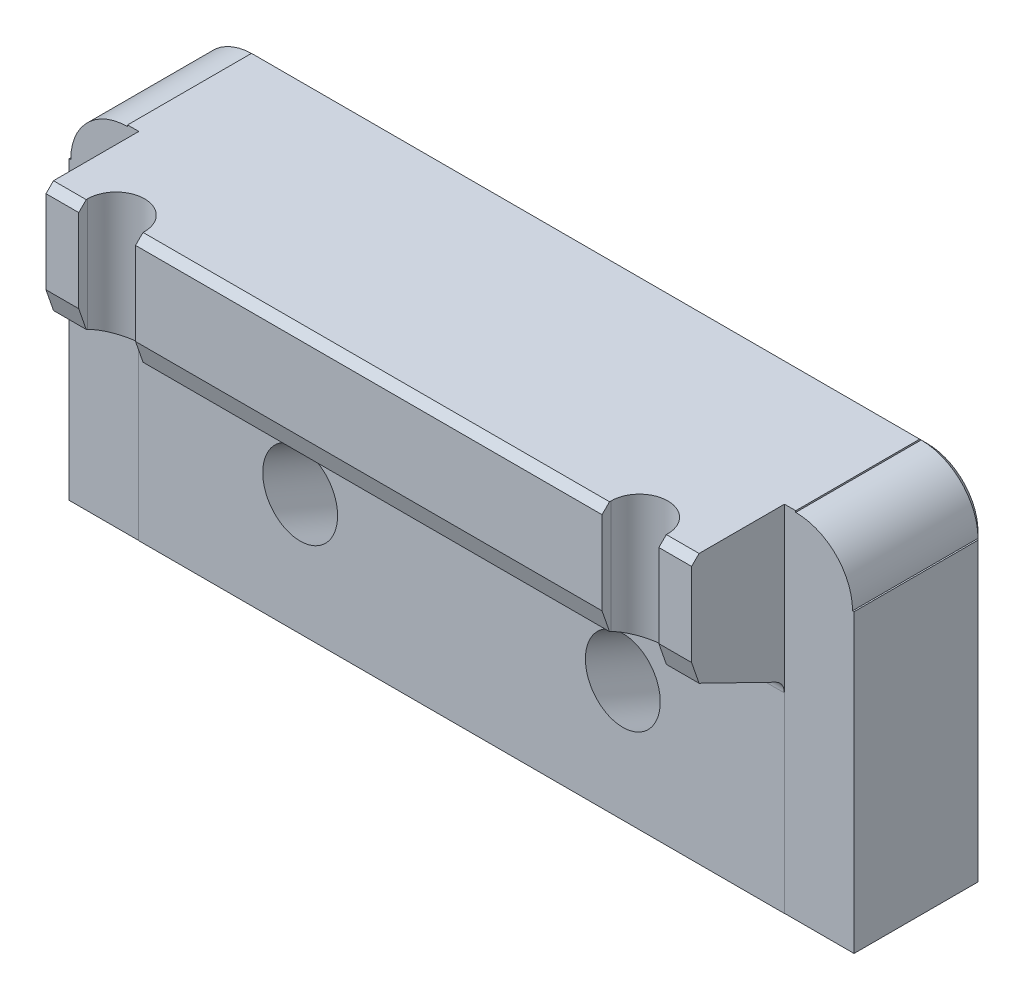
ISO-10303-21;
HEADER;
FILE_DESCRIPTION(('STEP AP214'),'2;1');
FILE_NAME('part.step','',(''),(''),'','','');
FILE_SCHEMA(('AUTOMOTIVE_DESIGN { 1 0 10303 214 1 1 1 1 }'));
ENDSEC;
DATA;
#1=APPLICATION_CONTEXT('core data for automotive mechanical design processes');
#2=APPLICATION_PROTOCOL_DEFINITION('international standard','automotive_design',2000,#1);
#3=PRODUCT_CONTEXT('',#1,'mechanical');
#4=PRODUCT('Part','Part','',(#3));
#5=PRODUCT_RELATED_PRODUCT_CATEGORY('part','',(#4));
#6=PRODUCT_DEFINITION_FORMATION('','',#4);
#7=PRODUCT_DEFINITION_CONTEXT('part definition',#1,'design');
#8=PRODUCT_DEFINITION('design','',#6,#7);
#9=PRODUCT_DEFINITION_SHAPE('','',#8);
#10=(LENGTH_UNIT() NAMED_UNIT(*) SI_UNIT(.MILLI.,.METRE.));
#11=(NAMED_UNIT(*) PLANE_ANGLE_UNIT() SI_UNIT($,.RADIAN.));
#12=(NAMED_UNIT(*) SI_UNIT($,.STERADIAN.) SOLID_ANGLE_UNIT());
#13=UNCERTAINTY_MEASURE_WITH_UNIT(LENGTH_MEASURE(1.E-05),#10,'distance_accuracy_value','');
#14=(GEOMETRIC_REPRESENTATION_CONTEXT(3) GLOBAL_UNCERTAINTY_ASSIGNED_CONTEXT((#13)) GLOBAL_UNIT_ASSIGNED_CONTEXT((#10,
#11,#12)) REPRESENTATION_CONTEXT('',''));
#15=CARTESIAN_POINT('',(0.,0.,0.));
#16=DIRECTION('',(0.,0.,1.));
#17=DIRECTION('',(1.,0.,0.));
#18=AXIS2_PLACEMENT_3D('',#15,#16,#17);
#19=CARTESIAN_POINT('',(66.6623,14.6876778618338,38.1));
#20=DIRECTION('',(0.,0.,-1.));
#21=DIRECTION('',(0.,1.,0.));
#22=AXIS2_PLACEMENT_3D('',#19,#20,#21);
#23=PLANE('',#22);
#24=DIRECTION('',(0.,-1.,0.));
#25=VECTOR('',#24,1.);
#26=CARTESIAN_POINT('',(-49.276,14.6876778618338,38.1));
#27=LINE('',#26,#25);
#28=CARTESIAN_POINT('',(-49.276,28.829,38.1));
#29=VERTEX_POINT('',#28);
#30=CARTESIAN_POINT('',(-49.276,14.6876778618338,38.1));
#31=VERTEX_POINT('',#30);
#32=EDGE_CURVE('E374',#29,#31,#27,.T.);
#33=ORIENTED_EDGE('',*,*,#32,.F.);
#34=DIRECTION('',(-1.,0.,0.));
#35=VECTOR('',#34,1.);
#36=CARTESIAN_POINT('',(66.6623,28.829,38.1));
#37=LINE('',#36,#35);
#38=CARTESIAN_POINT('',(-54.8386,28.829,38.1));
#39=VERTEX_POINT('',#38);
#40=EDGE_CURVE('E557',#29,#39,#37,.T.);
#41=ORIENTED_EDGE('',*,*,#40,.T.);
#42=DIRECTION('',(0.,-1.,0.));
#43=VECTOR('',#42,1.);
#44=CARTESIAN_POINT('',(-54.8386,38.3995230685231,38.1));
#45=LINE('',#44,#43);
#46=CARTESIAN_POINT('',(-54.8386,14.6876778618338,38.1));
#47=VERTEX_POINT('',#46);
#48=EDGE_CURVE('E419',#39,#47,#45,.T.);
#49=ORIENTED_EDGE('',*,*,#48,.T.);
#50=DIRECTION('',(-1.,0.,0.));
#51=VECTOR('',#50,1.);
#52=CARTESIAN_POINT('',(66.6623,14.6876778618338,38.1));
#53=LINE('',#52,#51);
#54=EDGE_CURVE('E472',#31,#47,#53,.T.);
#55=ORIENTED_EDGE('',*,*,#54,.F.);
#56=EDGE_LOOP('',(#33,#41,#49,#55));
#57=FACE_BOUND('',#56,.T.);
#58=ADVANCED_FACE('F16',(#57),#23,.F.);
#59=DIRECTION('',(0.,1.,0.));
#60=VECTOR('',#59,1.);
#61=CARTESIAN_POINT('',(39.624,14.6876778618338,38.1));
#62=LINE('',#61,#60);
#63=CARTESIAN_POINT('',(39.624,14.6876778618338,38.1));
#64=VERTEX_POINT('',#63);
#65=CARTESIAN_POINT('',(39.624,28.829,38.1));
#66=VERTEX_POINT('',#65);
#67=EDGE_CURVE('E397',#64,#66,#62,.T.);
#68=ORIENTED_EDGE('',*,*,#67,.T.);
#69=DIRECTION('',(-1.,0.,0.));
#70=VECTOR('',#69,1.);
#71=CARTESIAN_POINT('',(66.6623,28.829,38.1));
#72=LINE('',#71,#70);
#73=CARTESIAN_POINT('',(-39.624,28.829,38.1));
#74=VERTEX_POINT('',#73);
#75=EDGE_CURVE('E550',#66,#74,#72,.T.);
#76=ORIENTED_EDGE('',*,*,#75,.T.);
#77=DIRECTION('',(0.,1.,0.));
#78=VECTOR('',#77,1.);
#79=CARTESIAN_POINT('',(-39.624,14.6876778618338,38.1));
#80=LINE('',#79,#78);
#81=CARTESIAN_POINT('',(-39.624,14.6876778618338,38.1));
#82=VERTEX_POINT('',#81);
#83=EDGE_CURVE('E369',#82,#74,#80,.T.);
#84=ORIENTED_EDGE('',*,*,#83,.F.);
#85=EDGE_CURVE('E478',#64,#82,#53,.T.);
#86=ORIENTED_EDGE('',*,*,#85,.F.);
#87=EDGE_LOOP('',(#68,#76,#84,#86));
#88=FACE_BOUND('',#87,.T.);
#89=ADVANCED_FACE('F726',(#88),#23,.F.);
#90=CARTESIAN_POINT('',(66.6623,10.9993300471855,36.83));
#91=DIRECTION('',(0.,0.325568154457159,-0.945518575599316));
#92=DIRECTION('',(0.,0.945518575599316,0.325568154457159));
#93=AXIS2_PLACEMENT_3D('',#90,#91,#92);
#94=PLANE('',#93);
#95=DIRECTION('',(0.,-0.945518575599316,-0.325568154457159));
#96=VECTOR('',#95,1.);
#97=CARTESIAN_POINT('',(-49.276,10.9993300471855,36.83));
#98=LINE('',#97,#96);
#99=CARTESIAN_POINT('',(-49.276,10.9993300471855,36.83));
#100=VERTEX_POINT('',#99);
#101=EDGE_CURVE('E372',#31,#100,#98,.T.);
#102=ORIENTED_EDGE('',*,*,#101,.F.);
#103=ORIENTED_EDGE('',*,*,#54,.T.);
#104=DIRECTION('',(0.,0.945518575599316,0.325568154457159));
#105=VECTOR('',#104,1.);
#106=CARTESIAN_POINT('',(-54.8386,10.9993300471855,36.83));
#107=LINE('',#106,#105);
#108=CARTESIAN_POINT('',(-54.8386,10.9993300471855,36.83));
#109=VERTEX_POINT('',#108);
#110=EDGE_CURVE('E454',#109,#47,#107,.T.);
#111=ORIENTED_EDGE('',*,*,#110,.F.);
#112=DIRECTION('',(-1.,0.,0.));
#113=VECTOR('',#112,1.);
#114=CARTESIAN_POINT('',(66.6623,10.9993300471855,36.83));
#115=LINE('',#114,#113);
#116=EDGE_CURVE('E468',#100,#109,#115,.T.);
#117=ORIENTED_EDGE('',*,*,#116,.F.);
#118=EDGE_LOOP('',(#102,#103,#111,#117));
#119=FACE_BOUND('',#118,.T.);
#120=ADVANCED_FACE('F732',(#119),#94,.F.);
#121=DIRECTION('',(0.,0.945518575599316,0.325568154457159));
#122=VECTOR('',#121,1.);
#123=CARTESIAN_POINT('',(-39.624,10.9993300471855,36.83));
#124=LINE('',#123,#122);
#125=CARTESIAN_POINT('',(-39.624,10.9993300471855,36.83));
#126=VERTEX_POINT('',#125);
#127=EDGE_CURVE('E366',#126,#82,#124,.T.);
#128=ORIENTED_EDGE('',*,*,#127,.F.);
#129=CARTESIAN_POINT('',(39.624,10.9993300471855,36.83));
#130=VERTEX_POINT('',#129);
#131=EDGE_CURVE('E473',#130,#126,#115,.T.);
#132=ORIENTED_EDGE('',*,*,#131,.F.);
#133=DIRECTION('',(0.,0.945518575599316,0.325568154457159));
#134=VECTOR('',#133,1.);
#135=CARTESIAN_POINT('',(39.624,10.9993300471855,36.83));
#136=LINE('',#135,#134);
#137=EDGE_CURVE('E394',#130,#64,#136,.T.);
#138=ORIENTED_EDGE('',*,*,#137,.T.);
#139=ORIENTED_EDGE('',*,*,#85,.T.);
#140=EDGE_LOOP('',(#128,#132,#138,#139));
#141=FACE_BOUND('',#140,.T.);
#142=ADVANCED_FACE('F742',(#141),#94,.F.);
#143=CARTESIAN_POINT('',(66.6623,30.099,38.1));
#144=DIRECTION('',(0.,-1.,0.));
#145=DIRECTION('',(0.,0.,-1.));
#146=AXIS2_PLACEMENT_3D('',#143,#144,#145);
#147=PLANE('',#146);
#148=DIRECTION('',(0.,0.,-1.));
#149=VECTOR('',#148,1.);
#150=CARTESIAN_POINT('',(49.276,30.099,36.576));
#151=LINE('',#150,#149);
#152=CARTESIAN_POINT('',(49.276,30.099,36.83));
#153=VERTEX_POINT('',#152);
#154=CARTESIAN_POINT('',(49.276,30.099,36.576));
#155=VERTEX_POINT('',#154);
#156=EDGE_CURVE('E376',#153,#155,#151,.T.);
#157=ORIENTED_EDGE('',*,*,#156,.F.);
#158=DIRECTION('',(1.,0.,0.));
#159=VECTOR('',#158,1.);
#160=CARTESIAN_POINT('',(66.6623,30.099,36.83));
#161=LINE('',#160,#159);
#162=CARTESIAN_POINT('',(54.8386,30.099,36.83));
#163=VERTEX_POINT('',#162);
#164=EDGE_CURVE('E546',#153,#163,#161,.T.);
#165=ORIENTED_EDGE('',*,*,#164,.T.);
#166=DIRECTION('',(0.,0.,1.));
#167=VECTOR('',#166,1.);
#168=CARTESIAN_POINT('',(54.8386,30.099,38.1));
#169=LINE('',#168,#167);
#170=CARTESIAN_POINT('',(54.8386,30.099,22.3266));
#171=VERTEX_POINT('',#170);
#172=EDGE_CURVE('E446',#171,#163,#169,.T.);
#173=ORIENTED_EDGE('',*,*,#172,.F.);
#174=DIRECTION('',(-1.,0.,0.));
#175=VECTOR('',#174,1.);
#176=CARTESIAN_POINT('',(66.6623,30.099,22.3266));
#177=LINE('',#176,#175);
#178=CARTESIAN_POINT('',(56.7563,30.099,22.3266));
#179=VERTEX_POINT('',#178);
#180=EDGE_CURVE('E437',#179,#171,#177,.T.);
#181=ORIENTED_EDGE('',*,*,#180,.F.);
#182=DIRECTION('',(0.,0.,-1.));
#183=VECTOR('',#182,1.);
#184=CARTESIAN_POINT('',(56.7563,30.099,38.1));
#185=LINE('',#184,#183);
#186=CARTESIAN_POINT('',(56.7563,30.099,1.27));
#187=VERTEX_POINT('',#186);
#188=EDGE_CURVE('E412',#179,#187,#185,.T.);
#189=ORIENTED_EDGE('',*,*,#188,.T.);
#190=DIRECTION('',(-1.,0.,0.));
#191=VECTOR('',#190,1.);
#192=CARTESIAN_POINT('',(66.6623,30.099,1.27));
#193=LINE('',#192,#191);
#194=CARTESIAN_POINT('',(-56.7563,30.099,1.27));
#195=VERTEX_POINT('',#194);
#196=EDGE_CURVE('E539',#187,#195,#193,.T.);
#197=ORIENTED_EDGE('',*,*,#196,.T.);
#198=DIRECTION('',(0.,0.,-1.));
#199=VECTOR('',#198,1.);
#200=CARTESIAN_POINT('',(-56.7563,30.099,38.1));
#201=LINE('',#200,#199);
#202=CARTESIAN_POINT('',(-56.7563,30.099,22.3266));
#203=VERTEX_POINT('',#202);
#204=EDGE_CURVE('E406',#203,#195,#201,.T.);
#205=ORIENTED_EDGE('',*,*,#204,.F.);
#206=CARTESIAN_POINT('',(-54.8386,30.099,22.3266));
#207=VERTEX_POINT('',#206);
#208=EDGE_CURVE('E432',#207,#203,#177,.T.);
#209=ORIENTED_EDGE('',*,*,#208,.F.);
#210=DIRECTION('',(0.,0.,-1.));
#211=VECTOR('',#210,1.);
#212=CARTESIAN_POINT('',(-54.8386,30.099,38.1));
#213=LINE('',#212,#211);
#214=CARTESIAN_POINT('',(-54.8386,30.099,36.83));
#215=VERTEX_POINT('',#214);
#216=EDGE_CURVE('E457',#215,#207,#213,.T.);
#217=ORIENTED_EDGE('',*,*,#216,.F.);
#218=DIRECTION('',(1.,0.,0.));
#219=VECTOR('',#218,1.);
#220=CARTESIAN_POINT('',(66.6623,30.099,36.83));
#221=LINE('',#220,#219);
#222=CARTESIAN_POINT('',(-49.276,30.099,36.83));
#223=VERTEX_POINT('',#222);
#224=EDGE_CURVE('E542',#215,#223,#221,.T.);
#225=ORIENTED_EDGE('',*,*,#224,.T.);
#226=DIRECTION('',(0.,0.,-1.));
#227=VECTOR('',#226,1.);
#228=CARTESIAN_POINT('',(-49.276,30.099,36.576));
#229=LINE('',#228,#227);
#230=CARTESIAN_POINT('',(-49.276,30.099,36.576));
#231=VERTEX_POINT('',#230);
#232=EDGE_CURVE('E360',#223,#231,#229,.T.);
#233=ORIENTED_EDGE('',*,*,#232,.T.);
#234=CARTESIAN_POINT('',(-44.45,30.099,36.576));
#235=DIRECTION('',(0.,-1.,0.));
#236=DIRECTION('',(0.,0.,-1.));
#237=AXIS2_PLACEMENT_3D('',#234,#235,#236);
#238=CIRCLE('',#237,4.826);
#239=CARTESIAN_POINT('',(-39.624,30.099,36.576));
#240=VERTEX_POINT('',#239);
#241=EDGE_CURVE('E356',#231,#240,#238,.T.);
#242=ORIENTED_EDGE('',*,*,#241,.T.);
#243=DIRECTION('',(0.,0.,1.));
#244=VECTOR('',#243,1.);
#245=CARTESIAN_POINT('',(-39.624,30.099,56.3881036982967));
#246=LINE('',#245,#244);
#247=CARTESIAN_POINT('',(-39.624,30.099,36.83));
#248=VERTEX_POINT('',#247);
#249=EDGE_CURVE('E353',#240,#248,#246,.T.);
#250=ORIENTED_EDGE('',*,*,#249,.T.);
#251=DIRECTION('',(1.,0.,0.));
#252=VECTOR('',#251,1.);
#253=CARTESIAN_POINT('',(66.6623,30.099,36.83));
#254=LINE('',#253,#252);
#255=CARTESIAN_POINT('',(39.624,30.099,36.83));
#256=VERTEX_POINT('',#255);
#257=EDGE_CURVE('E544',#248,#256,#254,.T.);
#258=ORIENTED_EDGE('',*,*,#257,.T.);
#259=DIRECTION('',(0.,0.,1.));
#260=VECTOR('',#259,1.);
#261=CARTESIAN_POINT('',(39.624,30.099,56.3881036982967));
#262=LINE('',#261,#260);
#263=CARTESIAN_POINT('',(39.624,30.099,36.576));
#264=VERTEX_POINT('',#263);
#265=EDGE_CURVE('E381',#264,#256,#262,.T.);
#266=ORIENTED_EDGE('',*,*,#265,.F.);
#267=CARTESIAN_POINT('',(44.45,30.099,36.576));
#268=DIRECTION('',(0.,1.,0.));
#269=DIRECTION('',(0.,0.,-1.));
#270=AXIS2_PLACEMENT_3D('',#267,#268,#269);
#271=CIRCLE('',#270,4.826);
#272=EDGE_CURVE('E378',#155,#264,#271,.T.);
#273=ORIENTED_EDGE('',*,*,#272,.F.);
#274=EDGE_LOOP('',(#157,#165,#173,#181,#189,#197,#205,#209,#217,#225,#233,#242,#250,#258,#266,#273));
#275=FACE_BOUND('',#274,.T.);
#276=ADVANCED_FACE('F659',(#275),#147,.F.);
#277=CARTESIAN_POINT('',(66.6623,3.93793762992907,22.352));
#278=DIRECTION('',(0.,0.89879404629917,-0.438371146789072));
#279=DIRECTION('',(0.,0.438371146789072,0.89879404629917));
#280=AXIS2_PLACEMENT_3D('',#277,#278,#279);
#281=PLANE('',#280);
#282=DIRECTION('',(0.,0.438371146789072,0.89879404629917));
#283=VECTOR('',#282,1.);
#284=CARTESIAN_POINT('',(-54.8386,3.93793762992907,22.352));
#285=LINE('',#284,#283);
#286=CARTESIAN_POINT('',(-54.8386,4.63370635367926,23.7785372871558));
#287=VERTEX_POINT('',#286);
#288=EDGE_CURVE('E452',#287,#109,#285,.T.);
#289=ORIENTED_EDGE('',*,*,#288,.F.);
#290=DIRECTION('',(-1.,0.,0.));
#291=VECTOR('',#290,1.);
#292=CARTESIAN_POINT('',(54.8386,4.63370635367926,23.7785372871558));
#293=LINE('',#292,#291);
#294=CARTESIAN_POINT('',(54.8386,4.63370635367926,23.7785372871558));
#295=VERTEX_POINT('',#294);
#296=EDGE_CURVE('E520',#287,#295,#293,.F.);
#297=ORIENTED_EDGE('',*,*,#296,.T.);
#298=DIRECTION('',(0.,-0.438371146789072,-0.89879404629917));
#299=VECTOR('',#298,1.);
#300=CARTESIAN_POINT('',(54.8386,3.93793762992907,22.352));
#301=LINE('',#300,#299);
#302=CARTESIAN_POINT('',(54.8386,10.9993300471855,36.83));
#303=VERTEX_POINT('',#302);
#304=EDGE_CURVE('E441',#303,#295,#301,.T.);
#305=ORIENTED_EDGE('',*,*,#304,.F.);
#306=CARTESIAN_POINT('',(49.276,10.9993300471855,36.83));
#307=VERTEX_POINT('',#306);
#308=EDGE_CURVE('E469',#303,#307,#115,.T.);
#309=ORIENTED_EDGE('',*,*,#308,.T.);
#310=DIRECTION('',(0.,-0.438371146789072,-0.89879404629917));
#311=VECTOR('',#310,1.);
#312=CARTESIAN_POINT('',(49.276,3.93793762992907,22.352));
#313=LINE('',#312,#311);
#314=CARTESIAN_POINT('',(49.276,10.8754459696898,36.576));
#315=VERTEX_POINT('',#314);
#316=EDGE_CURVE('E501',#307,#315,#313,.T.);
#317=ORIENTED_EDGE('',*,*,#316,.T.);
#318=CARTESIAN_POINT('',(44.45,10.8754459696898,36.576));
#319=DIRECTION('',(0.,0.89879404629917,-0.438371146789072));
#320=DIRECTION('',(0.,0.438371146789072,0.89879404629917));
#321=AXIS2_PLACEMENT_3D('',#318,#319,#320);
#322=ELLIPSE('',#321,5.36941696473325,4.826);
#323=CARTESIAN_POINT('',(39.624,10.8754459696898,36.576));
#324=VERTEX_POINT('',#323);
#325=EDGE_CURVE('E504',#315,#324,#322,.T.);
#326=ORIENTED_EDGE('',*,*,#325,.T.);
#327=DIRECTION('',(0.,0.438371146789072,0.89879404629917));
#328=VECTOR('',#327,1.);
#329=CARTESIAN_POINT('',(39.624,3.93793762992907,22.352));
#330=LINE('',#329,#328);
#331=EDGE_CURVE('E507',#324,#130,#330,.T.);
#332=ORIENTED_EDGE('',*,*,#331,.T.);
#333=ORIENTED_EDGE('',*,*,#131,.T.);
#334=DIRECTION('',(0.,0.438371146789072,0.89879404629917));
#335=VECTOR('',#334,1.);
#336=CARTESIAN_POINT('',(-39.624,3.93793762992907,22.352));
#337=LINE('',#336,#335);
#338=CARTESIAN_POINT('',(-39.624,10.8754459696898,36.576));
#339=VERTEX_POINT('',#338);
#340=EDGE_CURVE('E510',#339,#126,#337,.T.);
#341=ORIENTED_EDGE('',*,*,#340,.F.);
#342=CARTESIAN_POINT('',(-44.45,10.8754459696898,36.576));
#343=DIRECTION('',(0.,0.89879404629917,-0.438371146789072));
#344=DIRECTION('',(0.,0.438371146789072,0.89879404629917));
#345=AXIS2_PLACEMENT_3D('',#342,#343,#344);
#346=ELLIPSE('',#345,5.36941696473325,4.826);
#347=CARTESIAN_POINT('',(-49.276,10.8754459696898,36.576));
#348=VERTEX_POINT('',#347);
#349=EDGE_CURVE('E512',#348,#339,#346,.F.);
#350=ORIENTED_EDGE('',*,*,#349,.F.);
#351=DIRECTION('',(0.,-0.438371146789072,-0.89879404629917));
#352=VECTOR('',#351,1.);
#353=CARTESIAN_POINT('',(-49.276,3.93793762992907,22.352));
#354=LINE('',#353,#352);
#355=EDGE_CURVE('E515',#100,#348,#354,.T.);
#356=ORIENTED_EDGE('',*,*,#355,.F.);
#357=ORIENTED_EDGE('',*,*,#116,.T.);
#358=EDGE_LOOP('',(#289,#297,#305,#309,#317,#326,#332,#333,#341,#350,#356,#357));
#359=FACE_BOUND('',#358,.T.);
#360=ADVANCED_FACE('F677',(#359),#281,.F.);
#361=CARTESIAN_POINT('',(-66.6623,30.099,22.352));
#362=DIRECTION('',(1.,0.,0.));
#363=DIRECTION('',(0.,0.,-1.));
#364=AXIS2_PLACEMENT_3D('',#361,#362,#363);
#365=PLANE('',#364);
#366=DIRECTION('',(0.,0.,1.));
#367=VECTOR('',#366,1.);
#368=CARTESIAN_POINT('',(-66.6623,20.193,22.352));
#369=LINE('',#368,#367);
#370=CARTESIAN_POINT('',(-66.6623,20.193,1.27));
#371=VERTEX_POINT('',#370);
#372=CARTESIAN_POINT('',(-66.6623,20.193,22.3266));
#373=VERTEX_POINT('',#372);
#374=EDGE_CURVE('E403',#371,#373,#369,.T.);
#375=ORIENTED_EDGE('',*,*,#374,.F.);
#376=DIRECTION('',(0.,-1.,0.));
#377=VECTOR('',#376,1.);
#378=CARTESIAN_POINT('',(-66.6623,30.099,1.27));
#379=LINE('',#378,#377);
#380=CARTESIAN_POINT('',(-66.6623,-30.099,1.27));
#381=VERTEX_POINT('',#380);
#382=EDGE_CURVE('E580',#371,#381,#379,.T.);
#383=ORIENTED_EDGE('',*,*,#382,.T.);
#384=DIRECTION('',(0.,0.,-1.));
#385=VECTOR('',#384,1.);
#386=CARTESIAN_POINT('',(-66.6623,-30.099,0.));
#387=LINE('',#386,#385);
#388=CARTESIAN_POINT('',(-66.6623,-30.099,22.3266));
#389=VERTEX_POINT('',#388);
#390=EDGE_CURVE('E459',#389,#381,#387,.T.);
#391=ORIENTED_EDGE('',*,*,#390,.F.);
#392=DIRECTION('',(0.,-1.,0.));
#393=VECTOR('',#392,1.);
#394=CARTESIAN_POINT('',(-66.6623,30.099,22.3266));
#395=LINE('',#394,#393);
#396=EDGE_CURVE('E477',#373,#389,#395,.T.);
#397=ORIENTED_EDGE('',*,*,#396,.F.);
#398=EDGE_LOOP('',(#375,#383,#391,#397));
#399=FACE_BOUND('',#398,.T.);
#400=ADVANCED_FACE('F619',(#399),#365,.F.);
#401=CARTESIAN_POINT('',(66.6623,30.099,0.));
#402=DIRECTION('',(0.,0.,1.));
#403=DIRECTION('',(1.,0.,0.));
#404=AXIS2_PLACEMENT_3D('',#401,#402,#403);
#405=PLANE('',#404);
#406=CARTESIAN_POINT('',(49.6316,-19.812,0.));
#407=DIRECTION('',(0.,0.,-1.));
#408=DIRECTION('',(-1.,0.,0.));
#409=AXIS2_PLACEMENT_3D('',#406,#407,#408);
#410=CIRCLE('',#409,3.96875);
#411=CARTESIAN_POINT('',(45.66285,-19.812,0.));
#412=VERTEX_POINT('',#411);
#413=EDGE_CURVE('E275',#412,#412,#410,.T.);
#414=ORIENTED_EDGE('',*,*,#413,.F.);
#415=EDGE_LOOP('',(#414));
#416=FACE_BOUND('',#415,.T.);
#417=CARTESIAN_POINT('',(49.6316,19.812,0.));
#418=DIRECTION('',(0.,0.,-1.));
#419=DIRECTION('',(-1.,0.,0.));
#420=AXIS2_PLACEMENT_3D('',#417,#418,#419);
#421=CIRCLE('',#420,3.96875);
#422=CARTESIAN_POINT('',(45.66285,19.812,0.));
#423=VERTEX_POINT('',#422);
#424=EDGE_CURVE('E287',#423,#423,#421,.T.);
#425=ORIENTED_EDGE('',*,*,#424,.F.);
#426=EDGE_LOOP('',(#425));
#427=FACE_BOUND('',#426,.T.);
#428=CARTESIAN_POINT('',(0.,19.812,0.));
#429=DIRECTION('',(0.,0.,-1.));
#430=DIRECTION('',(-1.,0.,0.));
#431=AXIS2_PLACEMENT_3D('',#428,#429,#430);
#432=CIRCLE('',#431,3.96875);
#433=CARTESIAN_POINT('',(-3.96875,19.812,0.));
#434=VERTEX_POINT('',#433);
#435=EDGE_CURVE('E299',#434,#434,#432,.T.);
#436=ORIENTED_EDGE('',*,*,#435,.F.);
#437=EDGE_LOOP('',(#436));
#438=FACE_BOUND('',#437,.T.);
#439=CARTESIAN_POINT('',(0.,-19.812,0.));
#440=DIRECTION('',(0.,0.,-1.));
#441=DIRECTION('',(-1.,0.,0.));
#442=AXIS2_PLACEMENT_3D('',#439,#440,#441);
#443=CIRCLE('',#442,3.96875);
#444=CARTESIAN_POINT('',(-3.96875,-19.812,0.));
#445=VERTEX_POINT('',#444);
#446=EDGE_CURVE('E311',#445,#445,#443,.T.);
#447=ORIENTED_EDGE('',*,*,#446,.F.);
#448=EDGE_LOOP('',(#447));
#449=FACE_BOUND('',#448,.T.);
#450=CARTESIAN_POINT('',(-49.6316,-19.812,0.));
#451=DIRECTION('',(0.,0.,-1.));
#452=DIRECTION('',(-1.,0.,0.));
#453=AXIS2_PLACEMENT_3D('',#450,#451,#452);
#454=CIRCLE('',#453,3.96875);
#455=CARTESIAN_POINT('',(-53.60035,-19.812,0.));
#456=VERTEX_POINT('',#455);
#457=EDGE_CURVE('E323',#456,#456,#454,.T.);
#458=ORIENTED_EDGE('',*,*,#457,.F.);
#459=EDGE_LOOP('',(#458));
#460=FACE_BOUND('',#459,.T.);
#461=CARTESIAN_POINT('',(-49.6316,19.812,0.));
#462=DIRECTION('',(0.,0.,-1.));
#463=DIRECTION('',(-1.,0.,0.));
#464=AXIS2_PLACEMENT_3D('',#461,#462,#463);
#465=CIRCLE('',#464,3.96875);
#466=CARTESIAN_POINT('',(-53.60035,19.812,0.));
#467=VERTEX_POINT('',#466);
#468=EDGE_CURVE('E335',#467,#467,#465,.T.);
#469=ORIENTED_EDGE('',*,*,#468,.F.);
#470=EDGE_LOOP('',(#469));
#471=FACE_BOUND('',#470,.T.);
#472=CARTESIAN_POINT('',(-27.4066,-19.0246,0.));
#473=DIRECTION('',(0.,0.,1.));
#474=DIRECTION('',(0.,-1.,0.));
#475=AXIS2_PLACEMENT_3D('',#472,#473,#474);
#476=ELLIPSE('',#475,9.51977598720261,8.763);
#477=CARTESIAN_POINT('',(-27.4066,-28.5443759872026,0.));
#478=VERTEX_POINT('',#477);
#479=EDGE_CURVE('E349',#478,#478,#476,.T.);
#480=ORIENTED_EDGE('',*,*,#479,.T.);
#481=EDGE_LOOP('',(#480));
#482=FACE_BOUND('',#481,.T.);
#483=CARTESIAN_POINT('',(27.4066,-19.0246,0.));
#484=DIRECTION('',(0.,0.,1.));
#485=DIRECTION('',(0.,-1.,0.));
#486=AXIS2_PLACEMENT_3D('',#483,#484,#485);
#487=ELLIPSE('',#486,9.51977598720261,8.763);
#488=CARTESIAN_POINT('',(27.4066,-28.5443759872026,0.));
#489=VERTEX_POINT('',#488);
#490=EDGE_CURVE('E357',#489,#489,#487,.T.);
#491=ORIENTED_EDGE('',*,*,#490,.T.);
#492=EDGE_LOOP('',(#491));
#493=FACE_BOUND('',#492,.T.);
#494=DIRECTION('',(1.,0.,0.));
#495=VECTOR('',#494,1.);
#496=CARTESIAN_POINT('',(66.6623,28.829,0.));
#497=LINE('',#496,#495);
#498=CARTESIAN_POINT('',(-56.7563,28.829,0.));
#499=VERTEX_POINT('',#498);
#500=CARTESIAN_POINT('',(56.7563,28.829,0.));
#501=VERTEX_POINT('',#500);
#502=EDGE_CURVE('E573',#499,#501,#497,.T.);
#503=ORIENTED_EDGE('',*,*,#502,.T.);
#504=CARTESIAN_POINT('',(56.7563,20.193,0.));
#505=DIRECTION('',(0.,0.,1.));
#506=DIRECTION('',(1.,0.,0.));
#507=AXIS2_PLACEMENT_3D('',#504,#505,#506);
#508=CIRCLE('',#507,8.636);
#509=CARTESIAN_POINT('',(65.3923,20.193,0.));
#510=VERTEX_POINT('',#509);
#511=EDGE_CURVE('E593',#501,#510,#508,.F.);
#512=ORIENTED_EDGE('',*,*,#511,.T.);
#513=DIRECTION('',(0.,-1.,0.));
#514=VECTOR('',#513,1.);
#515=CARTESIAN_POINT('',(65.3923,-30.099,0.));
#516=LINE('',#515,#514);
#517=CARTESIAN_POINT('',(65.3923,-28.829,0.));
#518=VERTEX_POINT('',#517);
#519=EDGE_CURVE('E567',#510,#518,#516,.T.);
#520=ORIENTED_EDGE('',*,*,#519,.T.);
#521=DIRECTION('',(-1.,0.,0.));
#522=VECTOR('',#521,1.);
#523=CARTESIAN_POINT('',(66.6623,-28.829,0.));
#524=LINE('',#523,#522);
#525=CARTESIAN_POINT('',(-65.3923,-28.829,0.));
#526=VERTEX_POINT('',#525);
#527=EDGE_CURVE('E569',#518,#526,#524,.T.);
#528=ORIENTED_EDGE('',*,*,#527,.T.);
#529=DIRECTION('',(0.,1.,0.));
#530=VECTOR('',#529,1.);
#531=CARTESIAN_POINT('',(-65.3923,30.099,0.));
#532=LINE('',#531,#530);
#533=CARTESIAN_POINT('',(-65.3923,20.193,0.));
#534=VERTEX_POINT('',#533);
#535=EDGE_CURVE('E571',#526,#534,#532,.T.);
#536=ORIENTED_EDGE('',*,*,#535,.T.);
#537=CARTESIAN_POINT('',(-56.7563,20.193,0.));
#538=DIRECTION('',(0.,0.,1.));
#539=DIRECTION('',(1.,0.,0.));
#540=AXIS2_PLACEMENT_3D('',#537,#538,#539);
#541=CIRCLE('',#540,8.636);
#542=EDGE_CURVE('E589',#534,#499,#541,.F.);
#543=ORIENTED_EDGE('',*,*,#542,.T.);
#544=EDGE_LOOP('',(#503,#512,#520,#528,#536,#543));
#545=FACE_BOUND('',#544,.T.);
#546=ADVANCED_FACE('F707',(#416,#427,#438,#449,#460,#471,#482,#493,#545),#405,.F.);
#547=CARTESIAN_POINT('',(0.,-9.82235179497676,22.3266));
#548=DIRECTION('',(0.,0.,1.));
#549=DIRECTION('',(1.,0.,0.));
#550=AXIS2_PLACEMENT_3D('',#547,#548,#549);
#551=PLANE('',#550);
#552=ORIENTED_EDGE('',*,*,#208,.T.);
#553=DIRECTION('',(0.,-1.,0.));
#554=VECTOR('',#553,1.);
#555=CARTESIAN_POINT('',(-56.7563,-9.82235179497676,22.3266));
#556=LINE('',#555,#554);
#557=CARTESIAN_POINT('',(-56.7563,29.845,22.3266));
#558=VERTEX_POINT('',#557);
#559=EDGE_CURVE('E498',#203,#558,#556,.T.);
#560=ORIENTED_EDGE('',*,*,#559,.T.);
#561=CARTESIAN_POINT('',(-56.7563,20.193,22.3266));
#562=DIRECTION('',(0.,0.,1.));
#563=DIRECTION('',(1.,0.,0.));
#564=AXIS2_PLACEMENT_3D('',#561,#562,#563);
#565=CIRCLE('',#564,9.652);
#566=CARTESIAN_POINT('',(-66.4083,20.193,22.3266));
#567=VERTEX_POINT('',#566);
#568=EDGE_CURVE('E495',#558,#567,#565,.T.);
#569=ORIENTED_EDGE('',*,*,#568,.T.);
#570=DIRECTION('',(-1.,0.,0.));
#571=VECTOR('',#570,1.);
#572=CARTESIAN_POINT('',(0.,20.193,22.3266));
#573=LINE('',#572,#571);
#574=EDGE_CURVE('E492',#567,#373,#573,.T.);
#575=ORIENTED_EDGE('',*,*,#574,.T.);
#576=ORIENTED_EDGE('',*,*,#396,.T.);
#577=DIRECTION('',(1.,0.,0.));
#578=VECTOR('',#577,1.);
#579=CARTESIAN_POINT('',(66.6623,-30.099,22.3266));
#580=LINE('',#579,#578);
#581=CARTESIAN_POINT('',(-54.8386,-30.099,22.3266));
#582=VERTEX_POINT('',#581);
#583=EDGE_CURVE('E430',#389,#582,#580,.T.);
#584=ORIENTED_EDGE('',*,*,#583,.T.);
#585=DIRECTION('',(0.,-1.,0.));
#586=VECTOR('',#585,1.);
#587=CARTESIAN_POINT('',(-54.8386,38.3995230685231,22.3266));
#588=LINE('',#587,#586);
#589=EDGE_CURVE('E424',#207,#582,#588,.T.);
#590=ORIENTED_EDGE('',*,*,#589,.F.);
#591=EDGE_LOOP('',(#552,#560,#569,#575,#576,#584,#590));
#592=FACE_BOUND('',#591,.T.);
#593=ADVANCED_FACE('F695',(#592),#551,.T.);
#594=DIRECTION('',(0.,1.,0.));
#595=VECTOR('',#594,1.);
#596=CARTESIAN_POINT('',(54.8386,38.3995230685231,38.1));
#597=LINE('',#596,#595);
#598=CARTESIAN_POINT('',(54.8386,14.6876778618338,38.1));
#599=VERTEX_POINT('',#598);
#600=CARTESIAN_POINT('',(54.8386,28.829,38.1));
#601=VERTEX_POINT('',#600);
#602=EDGE_CURVE('E421',#599,#601,#597,.T.);
#603=ORIENTED_EDGE('',*,*,#602,.T.);
#604=DIRECTION('',(-1.,0.,0.));
#605=VECTOR('',#604,1.);
#606=CARTESIAN_POINT('',(66.6623,28.829,38.1));
#607=LINE('',#606,#605);
#608=CARTESIAN_POINT('',(49.276,28.829,38.1));
#609=VERTEX_POINT('',#608);
#610=EDGE_CURVE('E526',#601,#609,#607,.T.);
#611=ORIENTED_EDGE('',*,*,#610,.T.);
#612=DIRECTION('',(0.,-1.,0.));
#613=VECTOR('',#612,1.);
#614=CARTESIAN_POINT('',(49.276,14.6876778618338,38.1));
#615=LINE('',#614,#613);
#616=CARTESIAN_POINT('',(49.276,14.6876778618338,38.1));
#617=VERTEX_POINT('',#616);
#618=EDGE_CURVE('E392',#609,#617,#615,.T.);
#619=ORIENTED_EDGE('',*,*,#618,.T.);
#620=EDGE_CURVE('E474',#599,#617,#53,.T.);
#621=ORIENTED_EDGE('',*,*,#620,.F.);
#622=EDGE_LOOP('',(#603,#611,#619,#621));
#623=FACE_BOUND('',#622,.T.);
#624=ADVANCED_FACE('F667',(#623),#23,.F.);
#625=ORIENTED_EDGE('',*,*,#620,.T.);
#626=DIRECTION('',(0.,-0.945518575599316,-0.325568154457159));
#627=VECTOR('',#626,1.);
#628=CARTESIAN_POINT('',(49.276,10.9993300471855,36.83));
#629=LINE('',#628,#627);
#630=EDGE_CURVE('E387',#617,#307,#629,.T.);
#631=ORIENTED_EDGE('',*,*,#630,.T.);
#632=ORIENTED_EDGE('',*,*,#308,.F.);
#633=DIRECTION('',(0.,-0.945518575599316,-0.325568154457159));
#634=VECTOR('',#633,1.);
#635=CARTESIAN_POINT('',(54.8386,10.9993300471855,36.83));
#636=LINE('',#635,#634);
#637=EDGE_CURVE('E444',#599,#303,#636,.T.);
#638=ORIENTED_EDGE('',*,*,#637,.F.);
#639=EDGE_LOOP('',(#625,#631,#632,#638));
#640=FACE_BOUND('',#639,.T.);
#641=ADVANCED_FACE('F671',(#640),#94,.F.);
#642=CARTESIAN_POINT('',(66.6623,-30.099,22.352));
#643=DIRECTION('',(0.,0.,-1.));
#644=DIRECTION('',(0.,1.,0.));
#645=AXIS2_PLACEMENT_3D('',#642,#643,#644);
#646=PLANE('',#645);
#647=CARTESIAN_POINT('',(-27.4066,-9.5367389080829,22.352));
#648=DIRECTION('',(0.,0.,-1.));
#649=DIRECTION('',(0.,-1.,0.));
#650=AXIS2_PLACEMENT_3D('',#647,#648,#649);
#651=ELLIPSE('',#650,6.90528678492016,6.35635);
#652=CARTESIAN_POINT('',(-27.4066,-16.4420256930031,22.352));
#653=VERTEX_POINT('',#652);
#654=EDGE_CURVE('E344',#653,#653,#651,.T.);
#655=ORIENTED_EDGE('',*,*,#654,.T.);
#656=EDGE_LOOP('',(#655));
#657=FACE_BOUND('',#656,.T.);
#658=CARTESIAN_POINT('',(27.4066,-9.5367389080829,22.352));
#659=DIRECTION('',(0.,0.,-1.));
#660=DIRECTION('',(0.,-1.,0.));
#661=AXIS2_PLACEMENT_3D('',#658,#659,#660);
#662=ELLIPSE('',#661,6.90528678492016,6.35635);
#663=CARTESIAN_POINT('',(27.4066,-16.4420256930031,22.352));
#664=VERTEX_POINT('',#663);
#665=EDGE_CURVE('E352',#664,#664,#662,.T.);
#666=ORIENTED_EDGE('',*,*,#665,.T.);
#667=EDGE_LOOP('',(#666));
#668=FACE_BOUND('',#667,.T.);
#669=DIRECTION('',(0.,-1.,0.));
#670=VECTOR('',#669,1.);
#671=CARTESIAN_POINT('',(54.8386,-30.099,22.352));
#672=LINE('',#671,#670);
#673=CARTESIAN_POINT('',(54.8386,2.35076947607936,22.352));
#674=VERTEX_POINT('',#673);
#675=CARTESIAN_POINT('',(54.8386,-30.099,22.352));
#676=VERTEX_POINT('',#675);
#677=EDGE_CURVE('E439',#674,#676,#672,.T.);
#678=ORIENTED_EDGE('',*,*,#677,.F.);
#679=DIRECTION('',(-1.,0.,0.));
#680=VECTOR('',#679,1.);
#681=CARTESIAN_POINT('',(-54.8386,2.35076947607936,22.352));
#682=LINE('',#681,#680);
#683=CARTESIAN_POINT('',(-54.8386,2.35076947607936,22.352));
#684=VERTEX_POINT('',#683);
#685=EDGE_CURVE('E517',#674,#684,#682,.T.);
#686=ORIENTED_EDGE('',*,*,#685,.T.);
#687=DIRECTION('',(0.,1.,0.));
#688=VECTOR('',#687,1.);
#689=CARTESIAN_POINT('',(-54.8386,-30.099,22.352));
#690=LINE('',#689,#688);
#691=CARTESIAN_POINT('',(-54.8386,-30.099,22.352));
#692=VERTEX_POINT('',#691);
#693=EDGE_CURVE('E449',#692,#684,#690,.T.);
#694=ORIENTED_EDGE('',*,*,#693,.F.);
#695=DIRECTION('',(-1.,0.,0.));
#696=VECTOR('',#695,1.);
#697=CARTESIAN_POINT('',(66.6623,-30.099,22.352));
#698=LINE('',#697,#696);
#699=EDGE_CURVE('E463',#676,#692,#698,.T.);
#700=ORIENTED_EDGE('',*,*,#699,.F.);
#701=EDGE_LOOP('',(#678,#686,#694,#700));
#702=FACE_BOUND('',#701,.T.);
#703=ADVANCED_FACE('F686',(#657,#668,#702),#646,.F.);
#704=CARTESIAN_POINT('',(66.6623,-30.099,0.));
#705=DIRECTION('',(0.,1.,0.));
#706=DIRECTION('',(0.,0.,1.));
#707=AXIS2_PLACEMENT_3D('',#704,#705,#706);
#708=PLANE('',#707);
#709=ORIENTED_EDGE('',*,*,#390,.T.);
#710=DIRECTION('',(1.,0.,0.));
#711=VECTOR('',#710,1.);
#712=CARTESIAN_POINT('',(66.6623,-30.099,1.27));
#713=LINE('',#712,#711);
#714=CARTESIAN_POINT('',(66.6623,-30.099,1.27));
#715=VERTEX_POINT('',#714);
#716=EDGE_CURVE('E582',#381,#715,#713,.T.);
#717=ORIENTED_EDGE('',*,*,#716,.T.);
#718=DIRECTION('',(0.,0.,-1.));
#719=VECTOR('',#718,1.);
#720=CARTESIAN_POINT('',(66.6623,-30.099,0.));
#721=LINE('',#720,#719);
#722=CARTESIAN_POINT('',(66.6623,-30.099,22.3266));
#723=VERTEX_POINT('',#722);
#724=EDGE_CURVE('E460',#723,#715,#721,.T.);
#725=ORIENTED_EDGE('',*,*,#724,.F.);
#726=CARTESIAN_POINT('',(54.8386,-30.099,22.3266));
#727=VERTEX_POINT('',#726);
#728=EDGE_CURVE('E433',#727,#723,#580,.T.);
#729=ORIENTED_EDGE('',*,*,#728,.F.);
#730=DIRECTION('',(0.,0.,-1.));
#731=VECTOR('',#730,1.);
#732=CARTESIAN_POINT('',(54.8386,-30.099,0.));
#733=LINE('',#732,#731);
#734=EDGE_CURVE('E480',#676,#727,#733,.T.);
#735=ORIENTED_EDGE('',*,*,#734,.F.);
#736=ORIENTED_EDGE('',*,*,#699,.T.);
#737=DIRECTION('',(0.,0.,1.));
#738=VECTOR('',#737,1.);
#739=CARTESIAN_POINT('',(-54.8386,-30.099,0.));
#740=LINE('',#739,#738);
#741=EDGE_CURVE('E482',#582,#692,#740,.T.);
#742=ORIENTED_EDGE('',*,*,#741,.F.);
#743=ORIENTED_EDGE('',*,*,#583,.F.);
#744=EDGE_LOOP('',(#709,#717,#725,#729,#735,#736,#742,#743));
#745=FACE_BOUND('',#744,.T.);
#746=ADVANCED_FACE('F624',(#745),#708,.F.);
#747=CARTESIAN_POINT('',(66.6623,30.099,22.352));
#748=DIRECTION('',(1.,0.,0.));
#749=DIRECTION('',(0.,0.,-1.));
#750=AXIS2_PLACEMENT_3D('',#747,#748,#749);
#751=PLANE('',#750);
#752=ORIENTED_EDGE('',*,*,#724,.T.);
#753=DIRECTION('',(0.,1.,0.));
#754=VECTOR('',#753,1.);
#755=CARTESIAN_POINT('',(66.6623,20.193,1.27));
#756=LINE('',#755,#754);
#757=CARTESIAN_POINT('',(66.6623,20.193,1.27));
#758=VERTEX_POINT('',#757);
#759=EDGE_CURVE('E584',#715,#758,#756,.T.);
#760=ORIENTED_EDGE('',*,*,#759,.T.);
#761=DIRECTION('',(0.,0.,-1.));
#762=VECTOR('',#761,1.);
#763=CARTESIAN_POINT('',(66.6623,20.193,22.352));
#764=LINE('',#763,#762);
#765=CARTESIAN_POINT('',(66.6623,20.193,22.3266));
#766=VERTEX_POINT('',#765);
#767=EDGE_CURVE('E416',#766,#758,#764,.T.);
#768=ORIENTED_EDGE('',*,*,#767,.F.);
#769=DIRECTION('',(0.,-1.,0.));
#770=VECTOR('',#769,1.);
#771=CARTESIAN_POINT('',(66.6623,30.099,22.3266));
#772=LINE('',#771,#770);
#773=EDGE_CURVE('E436',#766,#723,#772,.T.);
#774=ORIENTED_EDGE('',*,*,#773,.T.);
#775=EDGE_LOOP('',(#752,#760,#768,#774));
#776=FACE_BOUND('',#775,.T.);
#777=ADVANCED_FACE('F638',(#776),#751,.T.);
#778=CARTESIAN_POINT('',(-54.8386,38.3995230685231,22.3266));
#779=DIRECTION('',(-1.,0.,0.));
#780=DIRECTION('',(0.,0.,1.));
#781=AXIS2_PLACEMENT_3D('',#778,#779,#780);
#782=PLANE('',#781);
#783=ORIENTED_EDGE('',*,*,#48,.F.);
#784=DIRECTION('',(0.,-0.707106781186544,0.707106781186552));
#785=VECTOR('',#784,1.);
#786=CARTESIAN_POINT('',(-54.8386,41.5009615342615,25.4280384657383));
#787=LINE('',#786,#785);
#788=EDGE_CURVE('E560',#39,#215,#787,.F.);
#789=ORIENTED_EDGE('',*,*,#788,.T.);
#790=ORIENTED_EDGE('',*,*,#216,.T.);
#791=ORIENTED_EDGE('',*,*,#589,.T.);
#792=ORIENTED_EDGE('',*,*,#741,.T.);
#793=ORIENTED_EDGE('',*,*,#693,.T.);
#794=CARTESIAN_POINT('',(-54.8386,2.35076947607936,24.892));
#795=DIRECTION('',(-1.,0.,0.));
#796=DIRECTION('',(0.,0.,1.));
#797=AXIS2_PLACEMENT_3D('',#794,#795,#796);
#798=CIRCLE('',#797,2.54);
#799=EDGE_CURVE('E522',#684,#287,#798,.F.);
#800=ORIENTED_EDGE('',*,*,#799,.T.);
#801=ORIENTED_EDGE('',*,*,#288,.T.);
#802=ORIENTED_EDGE('',*,*,#110,.T.);
#803=EDGE_LOOP('',(#783,#789,#790,#791,#792,#793,#800,#801,#802));
#804=FACE_BOUND('',#803,.T.);
#805=ADVANCED_FACE('F690',(#804),#782,.T.);
#806=CARTESIAN_POINT('',(54.8386,38.3995230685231,22.3266));
#807=DIRECTION('',(1.,0.,0.));
#808=DIRECTION('',(0.,1.,0.));
#809=AXIS2_PLACEMENT_3D('',#806,#807,#808);
#810=PLANE('',#809);
#811=ORIENTED_EDGE('',*,*,#172,.T.);
#812=DIRECTION('',(0.,0.707106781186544,-0.707106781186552));
#813=VECTOR('',#812,1.);
#814=CARTESIAN_POINT('',(54.8386,41.5009615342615,25.4280384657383));
#815=LINE('',#814,#813);
#816=EDGE_CURVE('E548',#163,#601,#815,.F.);
#817=ORIENTED_EDGE('',*,*,#816,.T.);
#818=ORIENTED_EDGE('',*,*,#602,.F.);
#819=ORIENTED_EDGE('',*,*,#637,.T.);
#820=ORIENTED_EDGE('',*,*,#304,.T.);
#821=CARTESIAN_POINT('',(54.8386,2.35076947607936,24.892));
#822=DIRECTION('',(1.,0.,0.));
#823=DIRECTION('',(0.,1.,0.));
#824=AXIS2_PLACEMENT_3D('',#821,#822,#823);
#825=CIRCLE('',#824,2.54);
#826=EDGE_CURVE('E524',#295,#674,#825,.F.);
#827=ORIENTED_EDGE('',*,*,#826,.T.);
#828=ORIENTED_EDGE('',*,*,#677,.T.);
#829=ORIENTED_EDGE('',*,*,#734,.T.);
#830=DIRECTION('',(0.,1.,0.));
#831=VECTOR('',#830,1.);
#832=CARTESIAN_POINT('',(54.8386,38.3995230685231,22.3266));
#833=LINE('',#832,#831);
#834=EDGE_CURVE('E427',#727,#171,#833,.T.);
#835=ORIENTED_EDGE('',*,*,#834,.T.);
#836=EDGE_LOOP('',(#811,#817,#818,#819,#820,#827,#828,#829,#835));
#837=FACE_BOUND('',#836,.T.);
#838=ADVANCED_FACE('F656',(#837),#810,.T.);
#839=DIRECTION('',(1.,0.,0.));
#840=VECTOR('',#839,1.);
#841=CARTESIAN_POINT('',(0.,20.193,22.3266));
#842=LINE('',#841,#840);
#843=CARTESIAN_POINT('',(66.4083,20.193,22.3266));
#844=VERTEX_POINT('',#843);
#845=EDGE_CURVE('E490',#844,#766,#842,.T.);
#846=ORIENTED_EDGE('',*,*,#845,.F.);
#847=CARTESIAN_POINT('',(56.7563,20.193,22.3266));
#848=DIRECTION('',(0.,0.,1.));
#849=DIRECTION('',(1.,0.,0.));
#850=AXIS2_PLACEMENT_3D('',#847,#848,#849);
#851=CIRCLE('',#850,9.652);
#852=CARTESIAN_POINT('',(56.7563,29.845,22.3266));
#853=VERTEX_POINT('',#852);
#854=EDGE_CURVE('E487',#853,#844,#851,.F.);
#855=ORIENTED_EDGE('',*,*,#854,.F.);
#856=DIRECTION('',(0.,-1.,0.));
#857=VECTOR('',#856,1.);
#858=CARTESIAN_POINT('',(56.7563,-9.82235179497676,22.3266));
#859=LINE('',#858,#857);
#860=EDGE_CURVE('E484',#179,#853,#859,.T.);
#861=ORIENTED_EDGE('',*,*,#860,.F.);
#862=ORIENTED_EDGE('',*,*,#180,.T.);
#863=ORIENTED_EDGE('',*,*,#834,.F.);
#864=ORIENTED_EDGE('',*,*,#728,.T.);
#865=ORIENTED_EDGE('',*,*,#773,.F.);
#866=EDGE_LOOP('',(#846,#855,#861,#862,#863,#864,#865));
#867=FACE_BOUND('',#866,.T.);
#868=ADVANCED_FACE('F646',(#867),#551,.T.);
#869=CARTESIAN_POINT('',(56.7563,37.465,0.));
#870=DIRECTION('',(-1.,0.,0.));
#871=DIRECTION('',(0.,0.,1.));
#872=AXIS2_PLACEMENT_3D('',#869,#870,#871);
#873=PLANE('',#872);
#874=DIRECTION('',(0.,0.,1.));
#875=VECTOR('',#874,1.);
#876=CARTESIAN_POINT('',(56.7563,29.845,0.));
#877=LINE('',#876,#875);
#878=CARTESIAN_POINT('',(56.7563,29.845,1.016));
#879=VERTEX_POINT('',#878);
#880=EDGE_CURVE('E409',#879,#853,#877,.T.);
#881=ORIENTED_EDGE('',*,*,#880,.F.);
#882=DIRECTION('',(0.,-0.707106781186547,-0.707106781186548));
#883=VECTOR('',#882,1.);
#884=CARTESIAN_POINT('',(56.7563,30.099,1.27));
#885=LINE('',#884,#883);
#886=EDGE_CURVE('E576',#879,#187,#885,.F.);
#887=ORIENTED_EDGE('',*,*,#886,.T.);
#888=ORIENTED_EDGE('',*,*,#188,.F.);
#889=ORIENTED_EDGE('',*,*,#860,.T.);
#890=EDGE_LOOP('',(#881,#887,#888,#889));
#891=FACE_BOUND('',#890,.T.);
#892=ADVANCED_FACE('F712',(#891),#873,.F.);
#893=CARTESIAN_POINT('',(66.4083,20.193,0.));
#894=DIRECTION('',(0.,-1.,0.));
#895=DIRECTION('',(0.,0.,-1.));
#896=AXIS2_PLACEMENT_3D('',#893,#894,#895);
#897=PLANE('',#896);
#898=ORIENTED_EDGE('',*,*,#767,.T.);
#899=DIRECTION('',(-0.707106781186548,0.,-0.707106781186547));
#900=VECTOR('',#899,1.);
#901=CARTESIAN_POINT('',(66.6623,20.193,1.27));
#902=LINE('',#901,#900);
#903=CARTESIAN_POINT('',(66.4083,20.193,1.016));
#904=VERTEX_POINT('',#903);
#905=EDGE_CURVE('E586',#758,#904,#902,.T.);
#906=ORIENTED_EDGE('',*,*,#905,.T.);
#907=DIRECTION('',(0.,0.,1.));
#908=VECTOR('',#907,1.);
#909=CARTESIAN_POINT('',(66.4083,20.193,0.));
#910=LINE('',#909,#908);
#911=EDGE_CURVE('E410',#904,#844,#910,.T.);
#912=ORIENTED_EDGE('',*,*,#911,.T.);
#913=ORIENTED_EDGE('',*,*,#845,.T.);
#914=EDGE_LOOP('',(#898,#906,#912,#913));
#915=FACE_BOUND('',#914,.T.);
#916=ADVANCED_FACE('F641',(#915),#897,.F.);
#917=CARTESIAN_POINT('',(56.7563,20.193,0.));
#918=DIRECTION('',(0.,0.,1.));
#919=DIRECTION('',(1.,0.,0.));
#920=AXIS2_PLACEMENT_3D('',#917,#918,#919);
#921=CYLINDRICAL_SURFACE('',#920,9.652);
#922=ORIENTED_EDGE('',*,*,#911,.F.);
#923=CARTESIAN_POINT('',(56.7563,20.193,1.01599999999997));
#924=DIRECTION('',(0.,0.,1.));
#925=DIRECTION('',(1.,0.,0.));
#926=AXIS2_PLACEMENT_3D('',#923,#924,#925);
#927=CIRCLE('',#926,9.652);
#928=EDGE_CURVE('E596',#904,#879,#927,.T.);
#929=ORIENTED_EDGE('',*,*,#928,.T.);
#930=ORIENTED_EDGE('',*,*,#880,.T.);
#931=ORIENTED_EDGE('',*,*,#854,.T.);
#932=EDGE_LOOP('',(#922,#929,#930,#931));
#933=FACE_BOUND('',#932,.T.);
#934=ADVANCED_FACE('F714',(#933),#921,.T.);
#935=CARTESIAN_POINT('',(-56.7563,37.465,0.));
#936=DIRECTION('',(-1.,0.,0.));
#937=DIRECTION('',(0.,0.,1.));
#938=AXIS2_PLACEMENT_3D('',#935,#936,#937);
#939=PLANE('',#938);
#940=ORIENTED_EDGE('',*,*,#204,.T.);
#941=DIRECTION('',(0.,0.707106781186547,0.707106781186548));
#942=VECTOR('',#941,1.);
#943=CARTESIAN_POINT('',(-56.7563,33.147,4.318));
#944=LINE('',#943,#942);
#945=CARTESIAN_POINT('',(-56.7563,29.845,1.016));
#946=VERTEX_POINT('',#945);
#947=EDGE_CURVE('E564',#195,#946,#944,.F.);
#948=ORIENTED_EDGE('',*,*,#947,.T.);
#949=DIRECTION('',(0.,0.,1.));
#950=VECTOR('',#949,1.);
#951=CARTESIAN_POINT('',(-56.7563,29.845,0.));
#952=LINE('',#951,#950);
#953=EDGE_CURVE('E401',#946,#558,#952,.T.);
#954=ORIENTED_EDGE('',*,*,#953,.T.);
#955=ORIENTED_EDGE('',*,*,#559,.F.);
#956=EDGE_LOOP('',(#940,#948,#954,#955));
#957=FACE_BOUND('',#956,.T.);
#958=ADVANCED_FACE('F700',(#957),#939,.T.);
#959=CARTESIAN_POINT('',(-66.4083,20.193,0.));
#960=DIRECTION('',(0.,1.,0.));
#961=DIRECTION('',(0.,0.,1.));
#962=AXIS2_PLACEMENT_3D('',#959,#960,#961);
#963=PLANE('',#962);
#964=DIRECTION('',(0.,0.,1.));
#965=VECTOR('',#964,1.);
#966=CARTESIAN_POINT('',(-66.4083,20.193,0.));
#967=LINE('',#966,#965);
#968=CARTESIAN_POINT('',(-66.4083,20.193,1.016));
#969=VERTEX_POINT('',#968);
#970=EDGE_CURVE('E400',#969,#567,#967,.T.);
#971=ORIENTED_EDGE('',*,*,#970,.F.);
#972=DIRECTION('',(0.707106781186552,0.,-0.707106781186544));
#973=VECTOR('',#972,1.);
#974=CARTESIAN_POINT('',(-65.9003,20.193,0.508));
#975=LINE('',#974,#973);
#976=EDGE_CURVE('E578',#969,#371,#975,.F.);
#977=ORIENTED_EDGE('',*,*,#976,.T.);
#978=ORIENTED_EDGE('',*,*,#374,.T.);
#979=ORIENTED_EDGE('',*,*,#574,.F.);
#980=EDGE_LOOP('',(#971,#977,#978,#979));
#981=FACE_BOUND('',#980,.T.);
#982=ADVANCED_FACE('F612',(#981),#963,.T.);
#983=CARTESIAN_POINT('',(-56.7563,20.193,0.));
#984=DIRECTION('',(0.,0.,1.));
#985=DIRECTION('',(1.,0.,0.));
#986=AXIS2_PLACEMENT_3D('',#983,#984,#985);
#987=CYLINDRICAL_SURFACE('',#986,9.652);
#988=ORIENTED_EDGE('',*,*,#953,.F.);
#989=CARTESIAN_POINT('',(-56.7563,20.193,1.01599999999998));
#990=DIRECTION('',(0.,0.,1.));
#991=DIRECTION('',(1.,0.,0.));
#992=AXIS2_PLACEMENT_3D('',#989,#990,#991);
#993=CIRCLE('',#992,9.652);
#994=EDGE_CURVE('E24',#946,#969,#993,.T.);
#995=ORIENTED_EDGE('',*,*,#994,.T.);
#996=ORIENTED_EDGE('',*,*,#970,.T.);
#997=ORIENTED_EDGE('',*,*,#568,.F.);
#998=EDGE_LOOP('',(#988,#995,#996,#997));
#999=FACE_BOUND('',#998,.T.);
#1000=ADVANCED_FACE('F606',(#999),#987,.T.);
#1001=CARTESIAN_POINT('',(39.624,-30.099,56.3881036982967));
#1002=DIRECTION('',(-1.,0.,0.));
#1003=DIRECTION('',(0.,0.,1.));
#1004=AXIS2_PLACEMENT_3D('',#1001,#1002,#1003);
#1005=PLANE('',#1004);
#1006=ORIENTED_EDGE('',*,*,#265,.T.);
#1007=DIRECTION('',(0.,0.707106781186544,-0.707106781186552));
#1008=VECTOR('',#1007,1.);
#1009=CARTESIAN_POINT('',(39.624,28.829,38.1));
#1010=LINE('',#1009,#1008);
#1011=EDGE_CURVE('E555',#256,#66,#1010,.F.);
#1012=ORIENTED_EDGE('',*,*,#1011,.T.);
#1013=ORIENTED_EDGE('',*,*,#67,.F.);
#1014=ORIENTED_EDGE('',*,*,#137,.F.);
#1015=ORIENTED_EDGE('',*,*,#331,.F.);
#1016=DIRECTION('',(0.,1.,0.));
#1017=VECTOR('',#1016,1.);
#1018=CARTESIAN_POINT('',(39.624,-30.099,36.576));
#1019=LINE('',#1018,#1017);
#1020=EDGE_CURVE('E385',#324,#264,#1019,.T.);
#1021=ORIENTED_EDGE('',*,*,#1020,.T.);
#1022=EDGE_LOOP('',(#1006,#1012,#1013,#1014,#1015,#1021));
#1023=FACE_BOUND('',#1022,.T.);
#1024=ADVANCED_FACE('F1212',(#1023),#1005,.F.);
#1025=CARTESIAN_POINT('',(44.45,-30.099,36.576));
#1026=DIRECTION('',(0.,1.,0.));
#1027=DIRECTION('',(0.,0.,1.));
#1028=AXIS2_PLACEMENT_3D('',#1025,#1026,#1027);
#1029=CYLINDRICAL_SURFACE('',#1028,4.826);
#1030=DIRECTION('',(0.,1.,0.));
#1031=VECTOR('',#1030,1.);
#1032=CARTESIAN_POINT('',(49.276,-30.099,36.576));
#1033=LINE('',#1032,#1031);
#1034=EDGE_CURVE('E384',#315,#155,#1033,.T.);
#1035=ORIENTED_EDGE('',*,*,#1034,.T.);
#1036=ORIENTED_EDGE('',*,*,#272,.T.);
#1037=ORIENTED_EDGE('',*,*,#1020,.F.);
#1038=ORIENTED_EDGE('',*,*,#325,.F.);
#1039=EDGE_LOOP('',(#1035,#1036,#1037,#1038));
#1040=FACE_BOUND('',#1039,.T.);
#1041=ADVANCED_FACE('F1202',(#1040),#1029,.F.);
#1042=CARTESIAN_POINT('',(49.276,-30.099,36.576));
#1043=DIRECTION('',(1.,0.,0.));
#1044=DIRECTION('',(0.,0.,-1.));
#1045=AXIS2_PLACEMENT_3D('',#1042,#1043,#1044);
#1046=PLANE('',#1045);
#1047=ORIENTED_EDGE('',*,*,#618,.F.);
#1048=DIRECTION('',(0.,-0.707106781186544,0.707106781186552));
#1049=VECTOR('',#1048,1.);
#1050=CARTESIAN_POINT('',(49.276,28.829,38.1));
#1051=LINE('',#1050,#1049);
#1052=EDGE_CURVE('E537',#609,#153,#1051,.F.);
#1053=ORIENTED_EDGE('',*,*,#1052,.T.);
#1054=ORIENTED_EDGE('',*,*,#156,.T.);
#1055=ORIENTED_EDGE('',*,*,#1034,.F.);
#1056=ORIENTED_EDGE('',*,*,#316,.F.);
#1057=ORIENTED_EDGE('',*,*,#630,.F.);
#1058=EDGE_LOOP('',(#1047,#1053,#1054,#1055,#1056,#1057));
#1059=FACE_BOUND('',#1058,.T.);
#1060=ADVANCED_FACE('F1191',(#1059),#1046,.F.);
#1061=CARTESIAN_POINT('',(-49.276,-30.099,36.576));
#1062=DIRECTION('',(1.,0.,0.));
#1063=DIRECTION('',(0.,0.,-1.));
#1064=AXIS2_PLACEMENT_3D('',#1061,#1062,#1063);
#1065=PLANE('',#1064);
#1066=ORIENTED_EDGE('',*,*,#232,.F.);
#1067=DIRECTION('',(0.,0.707106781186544,-0.707106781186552));
#1068=VECTOR('',#1067,1.);
#1069=CARTESIAN_POINT('',(-49.276,0.127000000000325,66.802));
#1070=LINE('',#1069,#1068);
#1071=EDGE_CURVE('E562',#223,#29,#1070,.F.);
#1072=ORIENTED_EDGE('',*,*,#1071,.T.);
#1073=ORIENTED_EDGE('',*,*,#32,.T.);
#1074=ORIENTED_EDGE('',*,*,#101,.T.);
#1075=ORIENTED_EDGE('',*,*,#355,.T.);
#1076=DIRECTION('',(0.,1.,0.));
#1077=VECTOR('',#1076,1.);
#1078=CARTESIAN_POINT('',(-49.276,-30.099,36.576));
#1079=LINE('',#1078,#1077);
#1080=EDGE_CURVE('E363',#348,#231,#1079,.T.);
#1081=ORIENTED_EDGE('',*,*,#1080,.T.);
#1082=EDGE_LOOP('',(#1066,#1072,#1073,#1074,#1075,#1081));
#1083=FACE_BOUND('',#1082,.T.);
#1084=ADVANCED_FACE('F1181',(#1083),#1065,.T.);
#1085=CARTESIAN_POINT('',(-44.45,-30.099,36.576));
#1086=DIRECTION('',(0.,1.,0.));
#1087=DIRECTION('',(0.,0.,1.));
#1088=AXIS2_PLACEMENT_3D('',#1085,#1086,#1087);
#1089=CYLINDRICAL_SURFACE('',#1088,4.826);
#1090=ORIENTED_EDGE('',*,*,#349,.T.);
#1091=DIRECTION('',(0.,1.,0.));
#1092=VECTOR('',#1091,1.);
#1093=CARTESIAN_POINT('',(-39.624,-30.099,36.576));
#1094=LINE('',#1093,#1092);
#1095=EDGE_CURVE('E362',#339,#240,#1094,.T.);
#1096=ORIENTED_EDGE('',*,*,#1095,.T.);
#1097=ORIENTED_EDGE('',*,*,#241,.F.);
#1098=ORIENTED_EDGE('',*,*,#1080,.F.);
#1099=EDGE_LOOP('',(#1090,#1096,#1097,#1098));
#1100=FACE_BOUND('',#1099,.T.);
#1101=ADVANCED_FACE('F1171',(#1100),#1089,.F.);
#1102=CARTESIAN_POINT('',(-39.624,-30.099,56.3881036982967));
#1103=DIRECTION('',(-1.,0.,0.));
#1104=DIRECTION('',(0.,0.,1.));
#1105=AXIS2_PLACEMENT_3D('',#1102,#1103,#1104);
#1106=PLANE('',#1105);
#1107=ORIENTED_EDGE('',*,*,#83,.T.);
#1108=DIRECTION('',(0.,-0.707106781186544,0.707106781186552));
#1109=VECTOR('',#1108,1.);
#1110=CARTESIAN_POINT('',(-39.624,-9.77905184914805,76.7080518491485));
#1111=LINE('',#1110,#1109);
#1112=EDGE_CURVE('E553',#74,#248,#1111,.F.);
#1113=ORIENTED_EDGE('',*,*,#1112,.T.);
#1114=ORIENTED_EDGE('',*,*,#249,.F.);
#1115=ORIENTED_EDGE('',*,*,#1095,.F.);
#1116=ORIENTED_EDGE('',*,*,#340,.T.);
#1117=ORIENTED_EDGE('',*,*,#127,.T.);
#1118=EDGE_LOOP('',(#1107,#1113,#1114,#1115,#1116,#1117));
#1119=FACE_BOUND('',#1118,.T.);
#1120=ADVANCED_FACE('F785',(#1119),#1106,.T.);
#1121=CARTESIAN_POINT('',(66.6623,2.35076947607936,24.892));
#1122=DIRECTION('',(1.,0.,0.));
#1123=DIRECTION('',(0.,0.,-1.));
#1124=AXIS2_PLACEMENT_3D('',#1121,#1122,#1123);
#1125=CYLINDRICAL_SURFACE('',#1124,2.54);
#1126=ORIENTED_EDGE('',*,*,#826,.F.);
#1127=ORIENTED_EDGE('',*,*,#296,.F.);
#1128=ORIENTED_EDGE('',*,*,#799,.F.);
#1129=ORIENTED_EDGE('',*,*,#685,.F.);
#1130=EDGE_LOOP('',(#1126,#1127,#1128,#1129));
#1131=FACE_BOUND('',#1130,.T.);
#1132=ADVANCED_FACE('F681',(#1131),#1125,.F.);
#1133=CARTESIAN_POINT('',(27.4066,-33.6739575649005,-34.511723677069));
#1134=DIRECTION('',(0.,-0.390731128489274,-0.92050485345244));
#1135=DIRECTION('',(0.,0.92050485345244,-0.390731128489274));
#1136=AXIS2_PLACEMENT_3D('',#1133,#1134,#1135);
#1137=CYLINDRICAL_SURFACE('',#1136,8.763);
#1138=CARTESIAN_POINT('',(27.4066,-17.1873889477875,4.32819800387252));
#1139=DIRECTION('',(0.,-0.390731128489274,-0.92050485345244));
#1140=DIRECTION('',(0.,0.92050485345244,-0.390731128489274));
#1141=AXIS2_PLACEMENT_3D('',#1138,#1139,#1140);
#1142=CIRCLE('',#1141,8.763);
#1143=CARTESIAN_POINT('',(27.4066,-9.12100491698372,0.904221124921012));
#1144=VERTEX_POINT('',#1143);
#1145=EDGE_CURVE('E348',#1144,#1144,#1142,.T.);
#1146=ORIENTED_EDGE('',*,*,#1145,.F.);
#1147=EDGE_LOOP('',(#1146));
#1148=FACE_BOUND('',#1147,.T.);
#1149=ORIENTED_EDGE('',*,*,#490,.F.);
#1150=EDGE_LOOP('',(#1149));
#1151=FACE_BOUND('',#1150,.T.);
#1152=ADVANCED_FACE('F784',(#1148,#1151),#1137,.F.);
#1153=CARTESIAN_POINT('',(27.4066,-33.6739575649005,-34.511723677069));
#1154=DIRECTION('',(0.,-0.390731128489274,-0.92050485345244));
#1155=DIRECTION('',(0.,0.92050485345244,-0.390731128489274));
#1156=AXIS2_PLACEMENT_3D('',#1153,#1154,#1155);
#1157=CYLINDRICAL_SURFACE('',#1156,6.35635);
#1158=CARTESIAN_POINT('',(27.4066,-17.1873889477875,4.32819800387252));
#1159=DIRECTION('',(0.,-0.390731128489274,-0.92050485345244));
#1160=DIRECTION('',(0.,0.92050485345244,-0.390731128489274));
#1161=AXIS2_PLACEMENT_3D('',#1158,#1159,#1160);
#1162=CIRCLE('',#1161,6.35635);
#1163=CARTESIAN_POINT('',(27.4066,-11.336337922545,1.84457419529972));
#1164=VERTEX_POINT('',#1163);
#1165=EDGE_CURVE('E345',#1164,#1164,#1162,.T.);
#1166=ORIENTED_EDGE('',*,*,#1165,.T.);
#1167=EDGE_LOOP('',(#1166));
#1168=FACE_BOUND('',#1167,.T.);
#1169=ORIENTED_EDGE('',*,*,#665,.F.);
#1170=EDGE_LOOP('',(#1169));
#1171=FACE_BOUND('',#1170,.T.);
#1172=ADVANCED_FACE('F1137',(#1168,#1171),#1157,.F.);
#1173=CARTESIAN_POINT('',(27.4066,-9.12100491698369,0.904221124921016));
#1174=DIRECTION('',(0.,0.390731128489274,0.92050485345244));
#1175=DIRECTION('',(0.,-0.92050485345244,0.390731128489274));
#1176=AXIS2_PLACEMENT_3D('',#1173,#1174,#1175);
#1177=PLANE('',#1176);
#1178=ORIENTED_EDGE('',*,*,#1165,.F.);
#1179=EDGE_LOOP('',(#1178));
#1180=FACE_BOUND('',#1179,.T.);
#1181=ORIENTED_EDGE('',*,*,#1145,.T.);
#1182=EDGE_LOOP('',(#1181));
#1183=FACE_BOUND('',#1182,.T.);
#1184=ADVANCED_FACE('F1127',(#1180,#1183),#1177,.F.);
#1185=CARTESIAN_POINT('',(-27.4066,-33.6739575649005,-34.511723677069));
#1186=DIRECTION('',(0.,-0.390731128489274,-0.92050485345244));
#1187=DIRECTION('',(0.,0.92050485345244,-0.390731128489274));
#1188=AXIS2_PLACEMENT_3D('',#1185,#1186,#1187);
#1189=CYLINDRICAL_SURFACE('',#1188,8.763);
#1190=CARTESIAN_POINT('',(-27.4066,-17.1873889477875,4.32819800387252));
#1191=DIRECTION('',(0.,0.390731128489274,0.92050485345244));
#1192=DIRECTION('',(0.,0.92050485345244,-0.390731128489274));
#1193=AXIS2_PLACEMENT_3D('',#1190,#1191,#1192);
#1194=CIRCLE('',#1193,8.763);
#1195=CARTESIAN_POINT('',(-27.4066,-9.12100491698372,0.904221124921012));
#1196=VERTEX_POINT('',#1195);
#1197=EDGE_CURVE('E341',#1196,#1196,#1194,.T.);
#1198=ORIENTED_EDGE('',*,*,#1197,.T.);
#1199=EDGE_LOOP('',(#1198));
#1200=FACE_BOUND('',#1199,.T.);
#1201=ORIENTED_EDGE('',*,*,#479,.F.);
#1202=EDGE_LOOP('',(#1201));
#1203=FACE_BOUND('',#1202,.T.);
#1204=ADVANCED_FACE('F1117',(#1200,#1203),#1189,.F.);
#1205=CARTESIAN_POINT('',(-27.4066,-33.6739575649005,-34.511723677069));
#1206=DIRECTION('',(0.,-0.390731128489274,-0.92050485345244));
#1207=DIRECTION('',(0.,0.92050485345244,-0.390731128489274));
#1208=AXIS2_PLACEMENT_3D('',#1205,#1206,#1207);
#1209=CYLINDRICAL_SURFACE('',#1208,6.35635);
#1210=CARTESIAN_POINT('',(-27.4066,-17.1873889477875,4.32819800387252));
#1211=DIRECTION('',(0.,0.390731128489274,0.92050485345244));
#1212=DIRECTION('',(0.,0.92050485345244,-0.390731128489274));
#1213=AXIS2_PLACEMENT_3D('',#1210,#1211,#1212);
#1214=CIRCLE('',#1213,6.35635);
#1215=CARTESIAN_POINT('',(-27.4066,-11.336337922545,1.84457419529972));
#1216=VERTEX_POINT('',#1215);
#1217=EDGE_CURVE('E338',#1216,#1216,#1214,.T.);
#1218=ORIENTED_EDGE('',*,*,#1217,.F.);
#1219=EDGE_LOOP('',(#1218));
#1220=FACE_BOUND('',#1219,.T.);
#1221=ORIENTED_EDGE('',*,*,#654,.F.);
#1222=EDGE_LOOP('',(#1221));
#1223=FACE_BOUND('',#1222,.T.);
#1224=ADVANCED_FACE('F1107',(#1220,#1223),#1209,.F.);
#1225=CARTESIAN_POINT('',(-27.4066,-9.12100491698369,0.904221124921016));
#1226=DIRECTION('',(0.,0.390731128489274,0.92050485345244));
#1227=DIRECTION('',(0.,-0.92050485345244,0.390731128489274));
#1228=AXIS2_PLACEMENT_3D('',#1225,#1226,#1227);
#1229=PLANE('',#1228);
#1230=ORIENTED_EDGE('',*,*,#1217,.T.);
#1231=EDGE_LOOP('',(#1230));
#1232=FACE_BOUND('',#1231,.T.);
#1233=ORIENTED_EDGE('',*,*,#1197,.F.);
#1234=EDGE_LOOP('',(#1233));
#1235=FACE_BOUND('',#1234,.T.);
#1236=ADVANCED_FACE('F1097',(#1232,#1235),#1229,.F.);
#1237=CARTESIAN_POINT('',(-49.6316,19.812,0.));
#1238=DIRECTION('',(0.,0.,-1.));
#1239=DIRECTION('',(-1.,0.,0.));
#1240=AXIS2_PLACEMENT_3D('',#1237,#1238,#1239);
#1241=CYLINDRICAL_SURFACE('',#1240,3.96875);
#1242=CARTESIAN_POINT('',(-49.6316,19.812,15.24));
#1243=DIRECTION('',(0.,0.,-1.));
#1244=DIRECTION('',(-1.,0.,0.));
#1245=AXIS2_PLACEMENT_3D('',#1242,#1243,#1244);
#1246=CIRCLE('',#1245,3.96875);
#1247=CARTESIAN_POINT('',(-53.60035,19.812,15.24));
#1248=VERTEX_POINT('',#1247);
#1249=EDGE_CURVE('E332',#1248,#1248,#1246,.T.);
#1250=ORIENTED_EDGE('',*,*,#1249,.F.);
#1251=EDGE_LOOP('',(#1250));
#1252=FACE_BOUND('',#1251,.T.);
#1253=ORIENTED_EDGE('',*,*,#468,.T.);
#1254=EDGE_LOOP('',(#1253));
#1255=FACE_BOUND('',#1254,.T.);
#1256=ADVANCED_FACE('F1087',(#1252,#1255),#1241,.F.);
#1257=CARTESIAN_POINT('',(-46.3677,19.812,15.24));
#1258=DIRECTION('',(0.,0.,1.));
#1259=DIRECTION('',(1.,0.,0.));
#1260=AXIS2_PLACEMENT_3D('',#1257,#1258,#1259);
#1261=PLANE('',#1260);
#1262=CARTESIAN_POINT('',(-49.6316,19.812,15.24));
#1263=DIRECTION('',(0.,0.,-1.));
#1264=DIRECTION('',(-1.,0.,0.));
#1265=AXIS2_PLACEMENT_3D('',#1262,#1263,#1264);
#1266=CIRCLE('',#1265,3.2639);
#1267=CARTESIAN_POINT('',(-52.8955,19.812,15.24));
#1268=VERTEX_POINT('',#1267);
#1269=EDGE_CURVE('E329',#1268,#1268,#1266,.T.);
#1270=ORIENTED_EDGE('',*,*,#1269,.F.);
#1271=EDGE_LOOP('',(#1270));
#1272=FACE_BOUND('',#1271,.T.);
#1273=ORIENTED_EDGE('',*,*,#1249,.T.);
#1274=EDGE_LOOP('',(#1273));
#1275=FACE_BOUND('',#1274,.T.);
#1276=ADVANCED_FACE('F1077',(#1272,#1275),#1261,.F.);
#1277=CARTESIAN_POINT('',(-49.6316,19.812,0.));
#1278=DIRECTION('',(0.,0.,-1.));
#1279=DIRECTION('',(-1.,0.,0.));
#1280=AXIS2_PLACEMENT_3D('',#1277,#1278,#1279);
#1281=CYLINDRICAL_SURFACE('',#1280,3.2639);
#1282=CARTESIAN_POINT('',(-49.6316,19.812,19.4691));
#1283=DIRECTION('',(0.,0.,-1.));
#1284=DIRECTION('',(-1.,0.,0.));
#1285=AXIS2_PLACEMENT_3D('',#1282,#1283,#1284);
#1286=CIRCLE('',#1285,3.2639);
#1287=CARTESIAN_POINT('',(-52.8955,19.812,19.4691));
#1288=VERTEX_POINT('',#1287);
#1289=EDGE_CURVE('E326',#1288,#1288,#1286,.T.);
#1290=ORIENTED_EDGE('',*,*,#1289,.F.);
#1291=EDGE_LOOP('',(#1290));
#1292=FACE_BOUND('',#1291,.T.);
#1293=ORIENTED_EDGE('',*,*,#1269,.T.);
#1294=EDGE_LOOP('',(#1293));
#1295=FACE_BOUND('',#1294,.T.);
#1296=ADVANCED_FACE('F1067',(#1292,#1295),#1281,.F.);
#1297=CARTESIAN_POINT('',(-49.6316,19.812,19.4691));
#1298=DIRECTION('',(0.,0.,-1.));
#1299=DIRECTION('',(-1.,0.,0.));
#1300=AXIS2_PLACEMENT_3D('',#1297,#1298,#1299);
#1301=CONICAL_SURFACE('',#1300,3.2639,1.02974425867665);
#1302=CARTESIAN_POINT('',(-49.6316,19.812,21.430248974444));
#1303=VERTEX_POINT('',#1302);
#1304=VERTEX_LOOP('',#1303);
#1305=FACE_BOUND('',#1304,.T.);
#1306=ORIENTED_EDGE('',*,*,#1289,.T.);
#1307=EDGE_LOOP('',(#1306));
#1308=FACE_BOUND('',#1307,.T.);
#1309=ADVANCED_FACE('F1057',(#1305,#1308),#1301,.F.);
#1310=CARTESIAN_POINT('',(-49.6316,-19.812,0.));
#1311=DIRECTION('',(0.,0.,-1.));
#1312=DIRECTION('',(-1.,0.,0.));
#1313=AXIS2_PLACEMENT_3D('',#1310,#1311,#1312);
#1314=CYLINDRICAL_SURFACE('',#1313,3.96875);
#1315=CARTESIAN_POINT('',(-49.6316,-19.812,15.24));
#1316=DIRECTION('',(0.,0.,-1.));
#1317=DIRECTION('',(-1.,0.,0.));
#1318=AXIS2_PLACEMENT_3D('',#1315,#1316,#1317);
#1319=CIRCLE('',#1318,3.96875);
#1320=CARTESIAN_POINT('',(-53.60035,-19.812,15.24));
#1321=VERTEX_POINT('',#1320);
#1322=EDGE_CURVE('E320',#1321,#1321,#1319,.T.);
#1323=ORIENTED_EDGE('',*,*,#1322,.F.);
#1324=EDGE_LOOP('',(#1323));
#1325=FACE_BOUND('',#1324,.T.);
#1326=ORIENTED_EDGE('',*,*,#457,.T.);
#1327=EDGE_LOOP('',(#1326));
#1328=FACE_BOUND('',#1327,.T.);
#1329=ADVANCED_FACE('F1047',(#1325,#1328),#1314,.F.);
#1330=CARTESIAN_POINT('',(-46.3677,-19.812,15.24));
#1331=DIRECTION('',(0.,0.,1.));
#1332=DIRECTION('',(1.,0.,0.));
#1333=AXIS2_PLACEMENT_3D('',#1330,#1331,#1332);
#1334=PLANE('',#1333);
#1335=CARTESIAN_POINT('',(-49.6316,-19.812,15.24));
#1336=DIRECTION('',(0.,0.,-1.));
#1337=DIRECTION('',(-1.,0.,0.));
#1338=AXIS2_PLACEMENT_3D('',#1335,#1336,#1337);
#1339=CIRCLE('',#1338,3.2639);
#1340=CARTESIAN_POINT('',(-52.8955,-19.812,15.24));
#1341=VERTEX_POINT('',#1340);
#1342=EDGE_CURVE('E317',#1341,#1341,#1339,.T.);
#1343=ORIENTED_EDGE('',*,*,#1342,.F.);
#1344=EDGE_LOOP('',(#1343));
#1345=FACE_BOUND('',#1344,.T.);
#1346=ORIENTED_EDGE('',*,*,#1322,.T.);
#1347=EDGE_LOOP('',(#1346));
#1348=FACE_BOUND('',#1347,.T.);
#1349=ADVANCED_FACE('F1037',(#1345,#1348),#1334,.F.);
#1350=CARTESIAN_POINT('',(-49.6316,-19.812,0.));
#1351=DIRECTION('',(0.,0.,-1.));
#1352=DIRECTION('',(-1.,0.,0.));
#1353=AXIS2_PLACEMENT_3D('',#1350,#1351,#1352);
#1354=CYLINDRICAL_SURFACE('',#1353,3.2639);
#1355=CARTESIAN_POINT('',(-49.6316,-19.812,19.4691));
#1356=DIRECTION('',(0.,0.,-1.));
#1357=DIRECTION('',(-1.,0.,0.));
#1358=AXIS2_PLACEMENT_3D('',#1355,#1356,#1357);
#1359=CIRCLE('',#1358,3.2639);
#1360=CARTESIAN_POINT('',(-52.8955,-19.812,19.4691));
#1361=VERTEX_POINT('',#1360);
#1362=EDGE_CURVE('E314',#1361,#1361,#1359,.T.);
#1363=ORIENTED_EDGE('',*,*,#1362,.F.);
#1364=EDGE_LOOP('',(#1363));
#1365=FACE_BOUND('',#1364,.T.);
#1366=ORIENTED_EDGE('',*,*,#1342,.T.);
#1367=EDGE_LOOP('',(#1366));
#1368=FACE_BOUND('',#1367,.T.);
#1369=ADVANCED_FACE('F1027',(#1365,#1368),#1354,.F.);
#1370=CARTESIAN_POINT('',(-49.6316,-19.812,19.4691));
#1371=DIRECTION('',(0.,0.,-1.));
#1372=DIRECTION('',(-1.,0.,0.));
#1373=AXIS2_PLACEMENT_3D('',#1370,#1371,#1372);
#1374=CONICAL_SURFACE('',#1373,3.2639,1.02974425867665);
#1375=CARTESIAN_POINT('',(-49.6316,-19.812,21.430248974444));
#1376=VERTEX_POINT('',#1375);
#1377=VERTEX_LOOP('',#1376);
#1378=FACE_BOUND('',#1377,.T.);
#1379=ORIENTED_EDGE('',*,*,#1362,.T.);
#1380=EDGE_LOOP('',(#1379));
#1381=FACE_BOUND('',#1380,.T.);
#1382=ADVANCED_FACE('F1017',(#1378,#1381),#1374,.F.);
#1383=CARTESIAN_POINT('',(0.,-19.812,0.));
#1384=DIRECTION('',(0.,0.,-1.));
#1385=DIRECTION('',(-1.,0.,0.));
#1386=AXIS2_PLACEMENT_3D('',#1383,#1384,#1385);
#1387=CYLINDRICAL_SURFACE('',#1386,3.96875);
#1388=CARTESIAN_POINT('',(0.,-19.812,15.24));
#1389=DIRECTION('',(0.,0.,-1.));
#1390=DIRECTION('',(-1.,0.,0.));
#1391=AXIS2_PLACEMENT_3D('',#1388,#1389,#1390);
#1392=CIRCLE('',#1391,3.96875);
#1393=CARTESIAN_POINT('',(-3.96875,-19.812,15.24));
#1394=VERTEX_POINT('',#1393);
#1395=EDGE_CURVE('E308',#1394,#1394,#1392,.T.);
#1396=ORIENTED_EDGE('',*,*,#1395,.F.);
#1397=EDGE_LOOP('',(#1396));
#1398=FACE_BOUND('',#1397,.T.);
#1399=ORIENTED_EDGE('',*,*,#446,.T.);
#1400=EDGE_LOOP('',(#1399));
#1401=FACE_BOUND('',#1400,.T.);
#1402=ADVANCED_FACE('F1007',(#1398,#1401),#1387,.F.);
#1403=CARTESIAN_POINT('',(3.2639,-19.812,15.24));
#1404=DIRECTION('',(0.,0.,1.));
#1405=DIRECTION('',(1.,0.,0.));
#1406=AXIS2_PLACEMENT_3D('',#1403,#1404,#1405);
#1407=PLANE('',#1406);
#1408=CARTESIAN_POINT('',(0.,-19.812,15.24));
#1409=DIRECTION('',(0.,0.,-1.));
#1410=DIRECTION('',(-1.,0.,0.));
#1411=AXIS2_PLACEMENT_3D('',#1408,#1409,#1410);
#1412=CIRCLE('',#1411,3.2639);
#1413=CARTESIAN_POINT('',(-3.2639,-19.812,15.24));
#1414=VERTEX_POINT('',#1413);
#1415=EDGE_CURVE('E305',#1414,#1414,#1412,.T.);
#1416=ORIENTED_EDGE('',*,*,#1415,.F.);
#1417=EDGE_LOOP('',(#1416));
#1418=FACE_BOUND('',#1417,.T.);
#1419=ORIENTED_EDGE('',*,*,#1395,.T.);
#1420=EDGE_LOOP('',(#1419));
#1421=FACE_BOUND('',#1420,.T.);
#1422=ADVANCED_FACE('F997',(#1418,#1421),#1407,.F.);
#1423=CARTESIAN_POINT('',(0.,-19.812,0.));
#1424=DIRECTION('',(0.,0.,-1.));
#1425=DIRECTION('',(-1.,0.,0.));
#1426=AXIS2_PLACEMENT_3D('',#1423,#1424,#1425);
#1427=CYLINDRICAL_SURFACE('',#1426,3.2639);
#1428=CARTESIAN_POINT('',(0.,-19.812,19.4691));
#1429=DIRECTION('',(0.,0.,-1.));
#1430=DIRECTION('',(-1.,0.,0.));
#1431=AXIS2_PLACEMENT_3D('',#1428,#1429,#1430);
#1432=CIRCLE('',#1431,3.2639);
#1433=CARTESIAN_POINT('',(-3.2639,-19.812,19.4691));
#1434=VERTEX_POINT('',#1433);
#1435=EDGE_CURVE('E302',#1434,#1434,#1432,.T.);
#1436=ORIENTED_EDGE('',*,*,#1435,.F.);
#1437=EDGE_LOOP('',(#1436));
#1438=FACE_BOUND('',#1437,.T.);
#1439=ORIENTED_EDGE('',*,*,#1415,.T.);
#1440=EDGE_LOOP('',(#1439));
#1441=FACE_BOUND('',#1440,.T.);
#1442=ADVANCED_FACE('F987',(#1438,#1441),#1427,.F.);
#1443=CARTESIAN_POINT('',(0.,-19.812,19.4691));
#1444=DIRECTION('',(0.,0.,-1.));
#1445=DIRECTION('',(-1.,0.,0.));
#1446=AXIS2_PLACEMENT_3D('',#1443,#1444,#1445);
#1447=CONICAL_SURFACE('',#1446,3.2639,1.02974425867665);
#1448=CARTESIAN_POINT('',(0.,-19.812,21.430248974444));
#1449=VERTEX_POINT('',#1448);
#1450=VERTEX_LOOP('',#1449);
#1451=FACE_BOUND('',#1450,.T.);
#1452=ORIENTED_EDGE('',*,*,#1435,.T.);
#1453=EDGE_LOOP('',(#1452));
#1454=FACE_BOUND('',#1453,.T.);
#1455=ADVANCED_FACE('F977',(#1451,#1454),#1447,.F.);
#1456=CARTESIAN_POINT('',(0.,19.812,0.));
#1457=DIRECTION('',(0.,0.,-1.));
#1458=DIRECTION('',(-1.,0.,0.));
#1459=AXIS2_PLACEMENT_3D('',#1456,#1457,#1458);
#1460=CYLINDRICAL_SURFACE('',#1459,3.96875);
#1461=CARTESIAN_POINT('',(0.,19.812,15.24));
#1462=DIRECTION('',(0.,0.,-1.));
#1463=DIRECTION('',(-1.,0.,0.));
#1464=AXIS2_PLACEMENT_3D('',#1461,#1462,#1463);
#1465=CIRCLE('',#1464,3.96875);
#1466=CARTESIAN_POINT('',(-3.96875,19.812,15.24));
#1467=VERTEX_POINT('',#1466);
#1468=EDGE_CURVE('E296',#1467,#1467,#1465,.T.);
#1469=ORIENTED_EDGE('',*,*,#1468,.F.);
#1470=EDGE_LOOP('',(#1469));
#1471=FACE_BOUND('',#1470,.T.);
#1472=ORIENTED_EDGE('',*,*,#435,.T.);
#1473=EDGE_LOOP('',(#1472));
#1474=FACE_BOUND('',#1473,.T.);
#1475=ADVANCED_FACE('F967',(#1471,#1474),#1460,.F.);
#1476=CARTESIAN_POINT('',(3.2639,19.812,15.24));
#1477=DIRECTION('',(0.,0.,1.));
#1478=DIRECTION('',(1.,0.,0.));
#1479=AXIS2_PLACEMENT_3D('',#1476,#1477,#1478);
#1480=PLANE('',#1479);
#1481=CARTESIAN_POINT('',(0.,19.812,15.24));
#1482=DIRECTION('',(0.,0.,-1.));
#1483=DIRECTION('',(-1.,0.,0.));
#1484=AXIS2_PLACEMENT_3D('',#1481,#1482,#1483);
#1485=CIRCLE('',#1484,3.2639);
#1486=CARTESIAN_POINT('',(-3.2639,19.812,15.24));
#1487=VERTEX_POINT('',#1486);
#1488=EDGE_CURVE('E293',#1487,#1487,#1485,.T.);
#1489=ORIENTED_EDGE('',*,*,#1488,.F.);
#1490=EDGE_LOOP('',(#1489));
#1491=FACE_BOUND('',#1490,.T.);
#1492=ORIENTED_EDGE('',*,*,#1468,.T.);
#1493=EDGE_LOOP('',(#1492));
#1494=FACE_BOUND('',#1493,.T.);
#1495=ADVANCED_FACE('F957',(#1491,#1494),#1480,.F.);
#1496=CARTESIAN_POINT('',(0.,19.812,0.));
#1497=DIRECTION('',(0.,0.,-1.));
#1498=DIRECTION('',(-1.,0.,0.));
#1499=AXIS2_PLACEMENT_3D('',#1496,#1497,#1498);
#1500=CYLINDRICAL_SURFACE('',#1499,3.2639);
#1501=CARTESIAN_POINT('',(0.,19.812,19.4691));
#1502=DIRECTION('',(0.,0.,-1.));
#1503=DIRECTION('',(-1.,0.,0.));
#1504=AXIS2_PLACEMENT_3D('',#1501,#1502,#1503);
#1505=CIRCLE('',#1504,3.2639);
#1506=CARTESIAN_POINT('',(-3.2639,19.812,19.4691));
#1507=VERTEX_POINT('',#1506);
#1508=EDGE_CURVE('E290',#1507,#1507,#1505,.T.);
#1509=ORIENTED_EDGE('',*,*,#1508,.F.);
#1510=EDGE_LOOP('',(#1509));
#1511=FACE_BOUND('',#1510,.T.);
#1512=ORIENTED_EDGE('',*,*,#1488,.T.);
#1513=EDGE_LOOP('',(#1512));
#1514=FACE_BOUND('',#1513,.T.);
#1515=ADVANCED_FACE('F947',(#1511,#1514),#1500,.F.);
#1516=CARTESIAN_POINT('',(0.,19.812,19.4691));
#1517=DIRECTION('',(0.,0.,-1.));
#1518=DIRECTION('',(-1.,0.,0.));
#1519=AXIS2_PLACEMENT_3D('',#1516,#1517,#1518);
#1520=CONICAL_SURFACE('',#1519,3.2639,1.02974425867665);
#1521=CARTESIAN_POINT('',(0.,19.812,21.430248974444));
#1522=VERTEX_POINT('',#1521);
#1523=VERTEX_LOOP('',#1522);
#1524=FACE_BOUND('',#1523,.T.);
#1525=ORIENTED_EDGE('',*,*,#1508,.T.);
#1526=EDGE_LOOP('',(#1525));
#1527=FACE_BOUND('',#1526,.T.);
#1528=ADVANCED_FACE('F937',(#1524,#1527),#1520,.F.);
#1529=CARTESIAN_POINT('',(49.6316,19.812,0.));
#1530=DIRECTION('',(0.,0.,-1.));
#1531=DIRECTION('',(-1.,0.,0.));
#1532=AXIS2_PLACEMENT_3D('',#1529,#1530,#1531);
#1533=CYLINDRICAL_SURFACE('',#1532,3.96875);
#1534=CARTESIAN_POINT('',(49.6316,19.812,15.24));
#1535=DIRECTION('',(0.,0.,-1.));
#1536=DIRECTION('',(-1.,0.,0.));
#1537=AXIS2_PLACEMENT_3D('',#1534,#1535,#1536);
#1538=CIRCLE('',#1537,3.96875);
#1539=CARTESIAN_POINT('',(45.66285,19.812,15.24));
#1540=VERTEX_POINT('',#1539);
#1541=EDGE_CURVE('E284',#1540,#1540,#1538,.T.);
#1542=ORIENTED_EDGE('',*,*,#1541,.F.);
#1543=EDGE_LOOP('',(#1542));
#1544=FACE_BOUND('',#1543,.T.);
#1545=ORIENTED_EDGE('',*,*,#424,.T.);
#1546=EDGE_LOOP('',(#1545));
#1547=FACE_BOUND('',#1546,.T.);
#1548=ADVANCED_FACE('F927',(#1544,#1547),#1533,.F.);
#1549=CARTESIAN_POINT('',(52.8955,19.812,15.24));
#1550=DIRECTION('',(0.,0.,1.));
#1551=DIRECTION('',(1.,0.,0.));
#1552=AXIS2_PLACEMENT_3D('',#1549,#1550,#1551);
#1553=PLANE('',#1552);
#1554=CARTESIAN_POINT('',(49.6316,19.812,15.24));
#1555=DIRECTION('',(0.,0.,-1.));
#1556=DIRECTION('',(-1.,0.,0.));
#1557=AXIS2_PLACEMENT_3D('',#1554,#1555,#1556);
#1558=CIRCLE('',#1557,3.2639);
#1559=CARTESIAN_POINT('',(46.3677,19.812,15.24));
#1560=VERTEX_POINT('',#1559);
#1561=EDGE_CURVE('E281',#1560,#1560,#1558,.T.);
#1562=ORIENTED_EDGE('',*,*,#1561,.F.);
#1563=EDGE_LOOP('',(#1562));
#1564=FACE_BOUND('',#1563,.T.);
#1565=ORIENTED_EDGE('',*,*,#1541,.T.);
#1566=EDGE_LOOP('',(#1565));
#1567=FACE_BOUND('',#1566,.T.);
#1568=ADVANCED_FACE('F917',(#1564,#1567),#1553,.F.);
#1569=CARTESIAN_POINT('',(49.6316,19.812,0.));
#1570=DIRECTION('',(0.,0.,-1.));
#1571=DIRECTION('',(-1.,0.,0.));
#1572=AXIS2_PLACEMENT_3D('',#1569,#1570,#1571);
#1573=CYLINDRICAL_SURFACE('',#1572,3.2639);
#1574=CARTESIAN_POINT('',(49.6316,19.812,19.4691));
#1575=DIRECTION('',(0.,0.,-1.));
#1576=DIRECTION('',(-1.,0.,0.));
#1577=AXIS2_PLACEMENT_3D('',#1574,#1575,#1576);
#1578=CIRCLE('',#1577,3.2639);
#1579=CARTESIAN_POINT('',(46.3677,19.812,19.4691));
#1580=VERTEX_POINT('',#1579);
#1581=EDGE_CURVE('E278',#1580,#1580,#1578,.T.);
#1582=ORIENTED_EDGE('',*,*,#1581,.F.);
#1583=EDGE_LOOP('',(#1582));
#1584=FACE_BOUND('',#1583,.T.);
#1585=ORIENTED_EDGE('',*,*,#1561,.T.);
#1586=EDGE_LOOP('',(#1585));
#1587=FACE_BOUND('',#1586,.T.);
#1588=ADVANCED_FACE('F907',(#1584,#1587),#1573,.F.);
#1589=CARTESIAN_POINT('',(49.6316,19.812,19.4691));
#1590=DIRECTION('',(0.,0.,-1.));
#1591=DIRECTION('',(-1.,0.,0.));
#1592=AXIS2_PLACEMENT_3D('',#1589,#1590,#1591);
#1593=CONICAL_SURFACE('',#1592,3.2639,1.02974425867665);
#1594=CARTESIAN_POINT('',(49.6316,19.812,21.430248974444));
#1595=VERTEX_POINT('',#1594);
#1596=VERTEX_LOOP('',#1595);
#1597=FACE_BOUND('',#1596,.T.);
#1598=ORIENTED_EDGE('',*,*,#1581,.T.);
#1599=EDGE_LOOP('',(#1598));
#1600=FACE_BOUND('',#1599,.T.);
#1601=ADVANCED_FACE('F897',(#1597,#1600),#1593,.F.);
#1602=CARTESIAN_POINT('',(49.6316,-19.812,0.));
#1603=DIRECTION('',(0.,0.,-1.));
#1604=DIRECTION('',(-1.,0.,0.));
#1605=AXIS2_PLACEMENT_3D('',#1602,#1603,#1604);
#1606=CYLINDRICAL_SURFACE('',#1605,3.96875);
#1607=CARTESIAN_POINT('',(49.6316,-19.812,15.24));
#1608=DIRECTION('',(0.,0.,-1.));
#1609=DIRECTION('',(-1.,0.,0.));
#1610=AXIS2_PLACEMENT_3D('',#1607,#1608,#1609);
#1611=CIRCLE('',#1610,3.96875);
#1612=CARTESIAN_POINT('',(45.66285,-19.812,15.24));
#1613=VERTEX_POINT('',#1612);
#1614=EDGE_CURVE('E267',#1613,#1613,#1611,.T.);
#1615=ORIENTED_EDGE('',*,*,#1614,.F.);
#1616=EDGE_LOOP('',(#1615));
#1617=FACE_BOUND('',#1616,.T.);
#1618=ORIENTED_EDGE('',*,*,#413,.T.);
#1619=EDGE_LOOP('',(#1618));
#1620=FACE_BOUND('',#1619,.T.);
#1621=ADVANCED_FACE('F887',(#1617,#1620),#1606,.F.);
#1622=CARTESIAN_POINT('',(52.8955,-19.812,15.24));
#1623=DIRECTION('',(0.,0.,1.));
#1624=DIRECTION('',(1.,0.,0.));
#1625=AXIS2_PLACEMENT_3D('',#1622,#1623,#1624);
#1626=PLANE('',#1625);
#1627=CARTESIAN_POINT('',(49.6316,-19.812,15.24));
#1628=DIRECTION('',(0.,0.,-1.));
#1629=DIRECTION('',(-1.,0.,0.));
#1630=AXIS2_PLACEMENT_3D('',#1627,#1628,#1629);
#1631=CIRCLE('',#1630,3.2639);
#1632=CARTESIAN_POINT('',(46.3677,-19.812,15.24));
#1633=VERTEX_POINT('',#1632);
#1634=EDGE_CURVE('E263',#1633,#1633,#1631,.T.);
#1635=ORIENTED_EDGE('',*,*,#1634,.F.);
#1636=EDGE_LOOP('',(#1635));
#1637=FACE_BOUND('',#1636,.T.);
#1638=ORIENTED_EDGE('',*,*,#1614,.T.);
#1639=EDGE_LOOP('',(#1638));
#1640=FACE_BOUND('',#1639,.T.);
#1641=ADVANCED_FACE('F878',(#1637,#1640),#1626,.F.);
#1642=CARTESIAN_POINT('',(49.6316,-19.812,0.));
#1643=DIRECTION('',(0.,0.,-1.));
#1644=DIRECTION('',(-1.,0.,0.));
#1645=AXIS2_PLACEMENT_3D('',#1642,#1643,#1644);
#1646=CYLINDRICAL_SURFACE('',#1645,3.2639);
#1647=CARTESIAN_POINT('',(49.6316,-19.812,19.4691));
#1648=DIRECTION('',(0.,0.,-1.));
#1649=DIRECTION('',(-1.,0.,0.));
#1650=AXIS2_PLACEMENT_3D('',#1647,#1648,#1649);
#1651=CIRCLE('',#1650,3.2639);
#1652=CARTESIAN_POINT('',(46.3677,-19.812,19.4691));
#1653=VERTEX_POINT('',#1652);
#1654=EDGE_CURVE('E261',#1653,#1653,#1651,.T.);
#1655=ORIENTED_EDGE('',*,*,#1654,.F.);
#1656=EDGE_LOOP('',(#1655));
#1657=FACE_BOUND('',#1656,.T.);
#1658=ORIENTED_EDGE('',*,*,#1634,.T.);
#1659=EDGE_LOOP('',(#1658));
#1660=FACE_BOUND('',#1659,.T.);
#1661=ADVANCED_FACE('F257',(#1657,#1660),#1646,.F.);
#1662=CARTESIAN_POINT('',(49.6316,-19.812,19.4691));
#1663=DIRECTION('',(0.,0.,-1.));
#1664=DIRECTION('',(-1.,0.,0.));
#1665=AXIS2_PLACEMENT_3D('',#1662,#1663,#1664);
#1666=CONICAL_SURFACE('',#1665,3.2639,1.02974425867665);
#1667=CARTESIAN_POINT('',(49.6316,-19.812,21.430248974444));
#1668=VERTEX_POINT('',#1667);
#1669=VERTEX_LOOP('',#1668);
#1670=FACE_BOUND('',#1669,.T.);
#1671=ORIENTED_EDGE('',*,*,#1654,.T.);
#1672=EDGE_LOOP('',(#1671));
#1673=FACE_BOUND('',#1672,.T.);
#1674=ADVANCED_FACE('F253',(#1670,#1673),#1666,.F.);
#1675=CARTESIAN_POINT('',(66.6623,28.829,38.1));
#1676=DIRECTION('',(0.,-0.707106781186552,-0.707106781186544));
#1677=DIRECTION('',(0.,0.707106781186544,-0.707106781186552));
#1678=AXIS2_PLACEMENT_3D('',#1675,#1676,#1677);
#1679=PLANE('',#1678);
#1680=ORIENTED_EDGE('',*,*,#816,.F.);
#1681=ORIENTED_EDGE('',*,*,#164,.F.);
#1682=ORIENTED_EDGE('',*,*,#1052,.F.);
#1683=ORIENTED_EDGE('',*,*,#610,.F.);
#1684=EDGE_LOOP('',(#1680,#1681,#1682,#1683));
#1685=FACE_BOUND('',#1684,.T.);
#1686=ADVANCED_FACE('F256',(#1685),#1679,.F.);
#1687=CARTESIAN_POINT('',(66.6623,28.829,38.1));
#1688=DIRECTION('',(0.,-0.707106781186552,-0.707106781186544));
#1689=DIRECTION('',(0.,0.707106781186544,-0.707106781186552));
#1690=AXIS2_PLACEMENT_3D('',#1687,#1688,#1689);
#1691=PLANE('',#1690);
#1692=ORIENTED_EDGE('',*,*,#1011,.F.);
#1693=ORIENTED_EDGE('',*,*,#257,.F.);
#1694=ORIENTED_EDGE('',*,*,#1112,.F.);
#1695=ORIENTED_EDGE('',*,*,#75,.F.);
#1696=EDGE_LOOP('',(#1692,#1693,#1694,#1695));
#1697=FACE_BOUND('',#1696,.T.);
#1698=ADVANCED_FACE('F788',(#1697),#1691,.F.);
#1699=CARTESIAN_POINT('',(66.6623,28.829,38.1));
#1700=DIRECTION('',(0.,-0.707106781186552,-0.707106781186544));
#1701=DIRECTION('',(0.,0.707106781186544,-0.707106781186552));
#1702=AXIS2_PLACEMENT_3D('',#1699,#1700,#1701);
#1703=PLANE('',#1702);
#1704=ORIENTED_EDGE('',*,*,#1071,.F.);
#1705=ORIENTED_EDGE('',*,*,#224,.F.);
#1706=ORIENTED_EDGE('',*,*,#788,.F.);
#1707=ORIENTED_EDGE('',*,*,#40,.F.);
#1708=EDGE_LOOP('',(#1704,#1705,#1706,#1707));
#1709=FACE_BOUND('',#1708,.T.);
#1710=ADVANCED_FACE('F791',(#1709),#1703,.F.);
#1711=CARTESIAN_POINT('',(66.6623,30.099,1.27));
#1712=DIRECTION('',(0.,-0.707106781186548,0.707106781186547));
#1713=DIRECTION('',(0.,-0.707106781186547,-0.707106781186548));
#1714=AXIS2_PLACEMENT_3D('',#1711,#1712,#1713);
#1715=PLANE('',#1714);
#1716=ORIENTED_EDGE('',*,*,#886,.F.);
#1717=DIRECTION('',(0.,0.707106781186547,0.707106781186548));
#1718=VECTOR('',#1717,1.);
#1719=CARTESIAN_POINT('',(56.7563,24.511,-4.318));
#1720=LINE('',#1719,#1718);
#1721=EDGE_CURVE('E600',#879,#501,#1720,.F.);
#1722=ORIENTED_EDGE('',*,*,#1721,.T.);
#1723=ORIENTED_EDGE('',*,*,#502,.F.);
#1724=DIRECTION('',(0.,0.707106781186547,0.707106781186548));
#1725=VECTOR('',#1724,1.);
#1726=CARTESIAN_POINT('',(-56.7563,25.019,-3.81));
#1727=LINE('',#1726,#1725);
#1728=EDGE_CURVE('E598',#499,#946,#1727,.T.);
#1729=ORIENTED_EDGE('',*,*,#1728,.T.);
#1730=ORIENTED_EDGE('',*,*,#947,.F.);
#1731=ORIENTED_EDGE('',*,*,#196,.F.);
#1732=EDGE_LOOP('',(#1716,#1722,#1723,#1729,#1730,#1731));
#1733=FACE_BOUND('',#1732,.T.);
#1734=ADVANCED_FACE('F703',(#1733),#1715,.F.);
#1735=CARTESIAN_POINT('',(66.6623,30.099,1.27));
#1736=DIRECTION('',(0.707106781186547,0.,-0.707106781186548));
#1737=DIRECTION('',(-0.707106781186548,0.,-0.707106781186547));
#1738=AXIS2_PLACEMENT_3D('',#1735,#1736,#1737);
#1739=PLANE('',#1738);
#1740=ORIENTED_EDGE('',*,*,#519,.F.);
#1741=DIRECTION('',(0.707106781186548,0.,0.707106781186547));
#1742=VECTOR('',#1741,1.);
#1743=CARTESIAN_POINT('',(61.0743,20.193,-4.318));
#1744=LINE('',#1743,#1742);
#1745=EDGE_CURVE('E37',#510,#904,#1744,.T.);
#1746=ORIENTED_EDGE('',*,*,#1745,.T.);
#1747=ORIENTED_EDGE('',*,*,#905,.F.);
#1748=ORIENTED_EDGE('',*,*,#759,.F.);
#1749=DIRECTION('',(0.577350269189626,-0.577350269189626,0.577350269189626));
#1750=VECTOR('',#1749,1.);
#1751=CARTESIAN_POINT('',(46.5963,-10.033,-18.796));
#1752=LINE('',#1751,#1750);
#1753=EDGE_CURVE('E264',#518,#715,#1752,.T.);
#1754=ORIENTED_EDGE('',*,*,#1753,.F.);
#1755=EDGE_LOOP('',(#1740,#1746,#1747,#1748,#1754));
#1756=FACE_BOUND('',#1755,.T.);
#1757=ADVANCED_FACE('F634',(#1756),#1739,.T.);
#1758=CARTESIAN_POINT('',(66.6623,-28.829,0.));
#1759=DIRECTION('',(0.,0.707106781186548,0.707106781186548));
#1760=DIRECTION('',(0.,-0.707106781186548,0.707106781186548));
#1761=AXIS2_PLACEMENT_3D('',#1758,#1759,#1760);
#1762=PLANE('',#1761);
#1763=ORIENTED_EDGE('',*,*,#1753,.T.);
#1764=ORIENTED_EDGE('',*,*,#716,.F.);
#1765=DIRECTION('',(0.57735026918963,0.577350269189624,-0.577350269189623));
#1766=VECTOR('',#1765,1.);
#1767=CARTESIAN_POINT('',(-21.3740999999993,15.1892,-44.0182));
#1768=LINE('',#1767,#1766);
#1769=EDGE_CURVE('E270',#526,#381,#1768,.F.);
#1770=ORIENTED_EDGE('',*,*,#1769,.F.);
#1771=ORIENTED_EDGE('',*,*,#527,.F.);
#1772=EDGE_LOOP('',(#1763,#1764,#1770,#1771));
#1773=FACE_BOUND('',#1772,.T.);
#1774=ADVANCED_FACE('F628',(#1773),#1762,.F.);
#1775=CARTESIAN_POINT('',(-65.3923,30.099,0.));
#1776=DIRECTION('',(0.707106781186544,0.,0.707106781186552));
#1777=DIRECTION('',(0.707106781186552,0.,-0.707106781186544));
#1778=AXIS2_PLACEMENT_3D('',#1775,#1776,#1777);
#1779=PLANE('',#1778);
#1780=ORIENTED_EDGE('',*,*,#976,.F.);
#1781=DIRECTION('',(-0.707106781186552,0.,0.707106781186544));
#1782=VECTOR('',#1781,1.);
#1783=CARTESIAN_POINT('',(-61.5823,20.193,-3.81));
#1784=LINE('',#1783,#1782);
#1785=EDGE_CURVE('E10',#969,#534,#1784,.F.);
#1786=ORIENTED_EDGE('',*,*,#1785,.T.);
#1787=ORIENTED_EDGE('',*,*,#535,.F.);
#1788=ORIENTED_EDGE('',*,*,#1769,.T.);
#1789=ORIENTED_EDGE('',*,*,#382,.F.);
#1790=EDGE_LOOP('',(#1780,#1786,#1787,#1788,#1789));
#1791=FACE_BOUND('',#1790,.T.);
#1792=ADVANCED_FACE('F615',(#1791),#1779,.F.);
#1793=CARTESIAN_POINT('',(56.7563,20.193,0.));
#1794=DIRECTION('',(0.,0.,1.));
#1795=DIRECTION('',(1.,0.,0.));
#1796=AXIS2_PLACEMENT_3D('',#1793,#1794,#1795);
#1797=CONICAL_SURFACE('',#1796,8.636,0.785398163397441);
#1798=ORIENTED_EDGE('',*,*,#1721,.F.);
#1799=ORIENTED_EDGE('',*,*,#928,.F.);
#1800=ORIENTED_EDGE('',*,*,#1745,.F.);
#1801=ORIENTED_EDGE('',*,*,#511,.F.);
#1802=EDGE_LOOP('',(#1798,#1799,#1800,#1801));
#1803=FACE_BOUND('',#1802,.T.);
#1804=ADVANCED_FACE('F709',(#1803),#1797,.T.);
#1805=CARTESIAN_POINT('',(-56.7563,20.193,1.01599999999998));
#1806=DIRECTION('',(0.,0.,1.));
#1807=DIRECTION('',(1.,0.,0.));
#1808=AXIS2_PLACEMENT_3D('',#1805,#1806,#1807);
#1809=CONICAL_SURFACE('',#1808,9.652,0.785398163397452);
#1810=ORIENTED_EDGE('',*,*,#1728,.F.);
#1811=ORIENTED_EDGE('',*,*,#542,.F.);
#1812=ORIENTED_EDGE('',*,*,#1785,.F.);
#1813=ORIENTED_EDGE('',*,*,#994,.F.);
#1814=EDGE_LOOP('',(#1810,#1811,#1812,#1813));
#1815=FACE_BOUND('',#1814,.T.);
#1816=ADVANCED_FACE('F18',(#1815),#1809,.T.);
#1817=CLOSED_SHELL('',(#58,#89,#120,#142,#276,#360,#400,#546,#593,#624,#641,#703,#746,#777,#805,
#838,#868,#892,#916,#934,#958,#982,#1000,#1024,#1041,#1060,#1084,#1101,#1120,#1132,#1152,#1172,
#1184,#1204,#1224,#1236,#1256,#1276,#1296,#1309,#1329,#1349,#1369,#1382,#1402,#1422,#1442,#1455,
#1475,#1495,#1515,#1528,#1548,#1568,#1588,#1601,#1621,#1641,#1661,#1674,#1686,#1698,#1710,#1734,
#1757,#1774,#1792,#1804,#1816));
#1818=MANIFOLD_SOLID_BREP('B1',#1817);
#1819=ADVANCED_BREP_SHAPE_REPRESENTATION('',(#18,#1818),#14);
#1820=SHAPE_DEFINITION_REPRESENTATION(#9,#1819);
ENDSEC;
END-ISO-10303-21;
